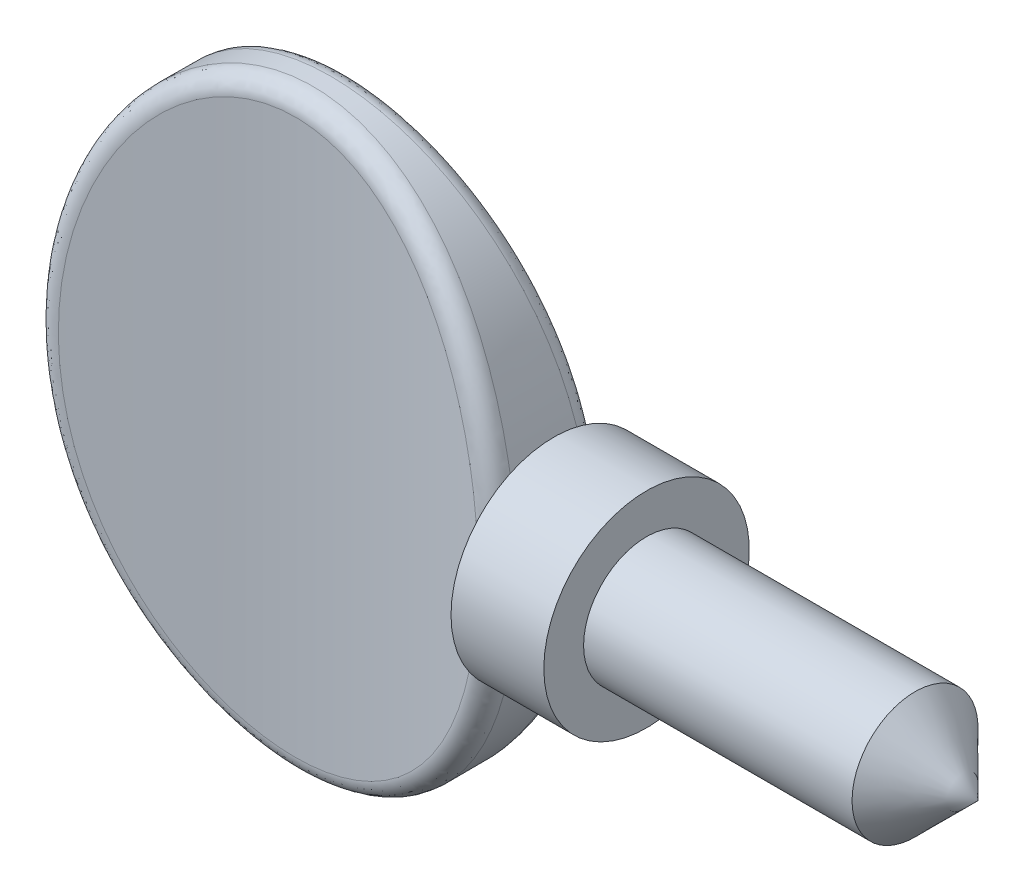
ISO-10303-21;
HEADER;
FILE_DESCRIPTION(('STEP AP214'),'2;1');
FILE_NAME('part.step','',(''),(''),'','','');
FILE_SCHEMA(('AUTOMOTIVE_DESIGN { 1 0 10303 214 1 1 1 1 }'));
ENDSEC;
DATA;
#1=APPLICATION_CONTEXT('core data for automotive mechanical design processes');
#2=APPLICATION_PROTOCOL_DEFINITION('international standard','automotive_design',2000,#1);
#3=PRODUCT_CONTEXT('',#1,'mechanical');
#4=PRODUCT('Part','Part','',(#3));
#5=PRODUCT_RELATED_PRODUCT_CATEGORY('part','',(#4));
#6=PRODUCT_DEFINITION_FORMATION('','',#4);
#7=PRODUCT_DEFINITION_CONTEXT('part definition',#1,'design');
#8=PRODUCT_DEFINITION('design','',#6,#7);
#9=PRODUCT_DEFINITION_SHAPE('','',#8);
#10=(LENGTH_UNIT() NAMED_UNIT(*) SI_UNIT(.MILLI.,.METRE.));
#11=(NAMED_UNIT(*) PLANE_ANGLE_UNIT() SI_UNIT($,.RADIAN.));
#12=(NAMED_UNIT(*) SI_UNIT($,.STERADIAN.) SOLID_ANGLE_UNIT());
#13=UNCERTAINTY_MEASURE_WITH_UNIT(LENGTH_MEASURE(1.E-05),#10,'distance_accuracy_value','');
#14=(GEOMETRIC_REPRESENTATION_CONTEXT(3) GLOBAL_UNCERTAINTY_ASSIGNED_CONTEXT((#13)) GLOBAL_UNIT_ASSIGNED_CONTEXT((#10,
#11,#12)) REPRESENTATION_CONTEXT('',''));
#15=CARTESIAN_POINT('',(0.,0.,0.));
#16=DIRECTION('',(0.,0.,1.));
#17=DIRECTION('',(1.,0.,0.));
#18=AXIS2_PLACEMENT_3D('',#15,#16,#17);
#19=CARTESIAN_POINT('',(0.,0.,2.286));
#20=DIRECTION('',(0.,0.,1.));
#21=DIRECTION('',(0.,1.,0.));
#22=AXIS2_PLACEMENT_3D('',#19,#20,#21);
#23=ELLIPSE('',#22,11.303,8.89);
#24=DIRECTION('',(0.,0.,-1.));
#25=VECTOR('',#24,1.);
#26=SURFACE_OF_LINEAR_EXTRUSION('',#23,#25);
#27=CARTESIAN_POINT('',(8.65241868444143,-2.59563035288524,1.41565744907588));
#28=CARTESIAN_POINT('',(8.64505380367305,-2.63527789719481,1.31316697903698));
#29=CARTESIAN_POINT('',(8.63830595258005,-2.67071705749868,1.20899028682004));
#30=CARTESIAN_POINT('',(8.62627848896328,-2.732857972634,0.997954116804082));
#31=CARTESIAN_POINT('',(8.6209992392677,-2.75955756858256,0.891093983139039));
#32=CARTESIAN_POINT('',(8.61214578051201,-2.8038850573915,0.675401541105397));
#33=CARTESIAN_POINT('',(8.60857205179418,-2.82151039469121,0.566568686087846));
#34=CARTESIAN_POINT('',(8.60328452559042,-2.84746342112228,0.347770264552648));
#35=CARTESIAN_POINT('',(8.60157044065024,-2.85579254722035,0.23780487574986));
#36=CARTESIAN_POINT('',(8.60008413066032,-2.86301911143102,0.018538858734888));
#37=CARTESIAN_POINT('',(8.60029463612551,-2.86200042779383,-0.0907588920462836));
#38=CARTESIAN_POINT('',(8.60260692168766,-2.8507444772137,-0.308858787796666));
#39=CARTESIAN_POINT('',(8.60470870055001,-2.8405072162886,-0.417660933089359));
#40=CARTESIAN_POINT('',(8.61070632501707,-2.810972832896,-0.633744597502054));
#41=CARTESIAN_POINT('',(8.61459849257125,-2.79169428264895,-0.741028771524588));
#42=CARTESIAN_POINT('',(8.62400975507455,-2.74432029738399,-0.953510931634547));
#43=CARTESIAN_POINT('',(8.62952797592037,-2.71622959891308,-1.05871000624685));
#44=CARTESIAN_POINT('',(8.63844994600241,-2.66982167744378,-1.20771767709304));
#45=CARTESIAN_POINT('',(8.64128872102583,-2.65493954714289,-1.25265626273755));
#46=CARTESIAN_POINT('',(8.64720516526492,-2.62361466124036,-1.34191094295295));
#47=CARTESIAN_POINT('',(8.65028255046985,-2.60717375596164,-1.3862277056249));
#48=CARTESIAN_POINT('',(8.65346985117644,-2.58995946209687,-1.43023949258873));
#49=B_SPLINE_CURVE_WITH_KNOTS('',3,(#27,#28,#29,#30,#31,#32,#33,#34,#35,#36,#37,#38,#39,#40,#41,
#42,#43,#44,#45,#46,#47,#48),.UNSPECIFIED.,.F.,.F.,(4,2,2,2,2,2,2,2,2,2,4),(0.,
0.330340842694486,0.660763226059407,0.991278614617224,1.3217429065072,1.64924484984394,
1.97674657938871,2.30357849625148,2.63023504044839,2.772481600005,2.91456137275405),.UNSPECIFIED.);
#50=CARTESIAN_POINT('',(8.64686129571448,-2.62539678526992,1.33619092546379));
#51=VERTEX_POINT('',#50);
#52=CARTESIAN_POINT('',(8.64686129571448,-2.62539678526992,-1.33619092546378));
#53=VERTEX_POINT('',#52);
#54=EDGE_CURVE('E166',#51,#53,#49,.T.);
#55=ORIENTED_EDGE('',*,*,#54,.F.);
#56=CARTESIAN_POINT('',(7.82629564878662,2.4351042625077,1.99569619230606));
#57=CARTESIAN_POINT('',(8.65245132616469,2.59576258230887,2.20582536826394));
#58=CARTESIAN_POINT('',(8.65956685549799,2.55680519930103,1.33926304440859));
#59=CARTESIAN_POINT('',(7.94743912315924,1.75770532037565,2.02649942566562));
#60=CARTESIAN_POINT('',(8.78692406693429,1.87112905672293,2.24349586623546));
#61=CARTESIAN_POINT('',(8.78960914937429,1.8448432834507,1.37072341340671));
#62=CARTESIAN_POINT('',(8.01716971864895,1.07004055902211,2.0448717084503));
#63=CARTESIAN_POINT('',(8.86351312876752,1.1404733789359,2.26573738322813));
#64=CARTESIAN_POINT('',(8.86432478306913,1.12299912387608,1.38948763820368));
#65=CARTESIAN_POINT('',(8.0547289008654,-0.309351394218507,2.05469325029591));
#66=CARTESIAN_POINT('',(8.90506846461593,-0.330332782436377,2.27771295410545));
#67=CARTESIAN_POINT('',(8.90458477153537,-0.324674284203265,1.399518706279));
#68=CARTESIAN_POINT('',(8.02243825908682,-1.00108239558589,2.04611100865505));
#69=CARTESIAN_POINT('',(8.86961883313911,-1.06541121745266,2.26732632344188));
#70=CARTESIAN_POINT('',(8.87000139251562,-1.05050720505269,1.39075337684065));
#71=CARTESIAN_POINT('',(7.89401839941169,-2.05341820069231,2.01297572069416));
#72=CARTESIAN_POINT('',(8.7273712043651,-2.18848798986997,2.22688533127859));
#73=CARTESIAN_POINT('',(8.7322517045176,-2.15566998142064,1.35691120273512));
#74=CARTESIAN_POINT('',(7.83428558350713,-2.41932216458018,1.99763575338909));
#75=CARTESIAN_POINT('',(8.66147254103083,-2.57804176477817,2.20823888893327));
#76=CARTESIAN_POINT('',(8.66816384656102,-2.54012241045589,1.34124398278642));
#77=CARTESIAN_POINT('',(7.68487396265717,-3.14447608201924,1.95997275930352));
#78=CARTESIAN_POINT('',(8.49634767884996,-3.35051128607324,2.16238668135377));
#79=CARTESIAN_POINT('',(8.50770464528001,-3.302633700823,1.30277751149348));
#80=CARTESIAN_POINT('',(7.59519051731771,-3.50372499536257,1.93764865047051));
#81=CARTESIAN_POINT('',(8.39743269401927,-3.73273694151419,2.13526405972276));
#82=CARTESIAN_POINT('',(8.41132829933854,-3.68069156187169,1.27997715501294));
#83=CARTESIAN_POINT('',(7.38556781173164,-4.21216799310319,1.88675959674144));
#84=CARTESIAN_POINT('',(8.16589203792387,-4.48682518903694,2.07336294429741));
#85=CARTESIAN_POINT('',(8.18576943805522,-4.42707064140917,1.22800246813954));
#86=CARTESIAN_POINT('',(7.26565071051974,-4.56136923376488,1.8581992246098));
#87=CARTESIAN_POINT('',(8.0337174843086,-4.85809981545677,2.03869510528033));
#88=CARTESIAN_POINT('',(8.05661094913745,-4.79539877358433,1.19883280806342));
#89=CARTESIAN_POINT('',(6.995124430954,-5.2464697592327,1.79585403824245));
#90=CARTESIAN_POINT('',(7.73510821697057,-5.5867008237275,1.96294144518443));
#91=CARTESIAN_POINT('',(7.76473855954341,-5.51911593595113,1.13515759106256));
#92=CARTESIAN_POINT('',(6.84452615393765,-5.58237371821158,1.76207108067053));
#93=CARTESIAN_POINT('',(7.56920233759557,-5.94356882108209,1.92197039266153));
#94=CARTESIAN_POINT('',(7.60203657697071,-5.87450950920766,1.10065393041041));
#95=CARTESIAN_POINT('',(6.43324199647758,-6.39240336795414,1.67357133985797));
#96=CARTESIAN_POINT('',(7.1165122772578,-6.80243787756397,1.81477728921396));
#97=CARTESIAN_POINT('',(7.15675137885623,-6.73320066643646,1.01026619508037));
#98=CARTESIAN_POINT('',(6.15417610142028,-6.85676635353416,1.61651047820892));
#99=CARTESIAN_POINT('',(6.80972916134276,-7.29531731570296,1.74570436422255));
#100=CARTESIAN_POINT('',(6.85386362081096,-7.22695535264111,0.951988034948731));
#101=CARTESIAN_POINT('',(5.52696453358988,-7.73305703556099,1.49913786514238));
#102=CARTESIAN_POINT('',(6.11796499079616,-8.22578037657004,1.60333969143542));
#103=CARTESIAN_POINT('',(6.17012522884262,-8.16227422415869,0.832111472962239));
#104=CARTESIAN_POINT('',(5.1789299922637,-8.14506735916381,1.43883145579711));
#105=CARTESIAN_POINT('',(5.73502064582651,-8.66343687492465,1.53025899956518));
#106=CARTESIAN_POINT('',(5.78939998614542,-8.60392057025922,0.770518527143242));
#107=CARTESIAN_POINT('',(4.49456535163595,-8.81832678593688,1.33426170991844));
#108=CARTESIAN_POINT('',(4.97849314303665,-9.37945459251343,1.4032069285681));
#109=CARTESIAN_POINT('',(5.0366311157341,-9.32899377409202,0.663717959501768));
#110=CARTESIAN_POINT('',(4.17119435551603,-9.09305461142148,1.28929359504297));
#111=CARTESIAN_POINT('',(4.62171828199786,-9.67163474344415,1.34859286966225));
#112=CARTESIAN_POINT('',(4.67963160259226,-9.62615608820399,0.617790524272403));
#113=CARTESIAN_POINT('',(3.65633336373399,-9.46244525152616,1.22675958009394));
#114=CARTESIAN_POINT('',(4.05119027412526,-10.0652330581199,1.27244557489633));
#115=CARTESIAN_POINT('',(4.10859190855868,-10.0272910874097,0.553922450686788));
#116=CARTESIAN_POINT('',(3.47966977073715,-9.5784960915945,1.2067276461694));
#117=CARTESIAN_POINT('',(3.85593810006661,-10.1886210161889,1.24810451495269));
#118=CARTESIAN_POINT('',(3.91223716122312,-10.1536091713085,0.533463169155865));
#119=CARTESIAN_POINT('',(3.11708209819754,-9.79472651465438,1.16885648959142));
#120=CARTESIAN_POINT('',(3.45504248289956,-10.4184405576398,1.20209344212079));
#121=CARTESIAN_POINT('',(3.50833839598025,-10.3894449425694,0.494784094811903));
#122=CARTESIAN_POINT('',(2.93116240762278,-9.89491352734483,1.15101624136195));
#123=CARTESIAN_POINT('',(3.2493632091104,-10.5250344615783,1.18039540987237));
#124=CARTESIAN_POINT('',(3.30079967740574,-10.4989704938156,0.476563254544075));
#125=CARTESIAN_POINT('',(2.54905941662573,-10.0787208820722,1.11790469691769));
#126=CARTESIAN_POINT('',(2.82653251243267,-10.7204996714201,1.14013561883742));
#127=CARTESIAN_POINT('',(2.87336447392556,-10.7002891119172,0.442745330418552));
#128=CARTESIAN_POINT('',(2.35279103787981,-10.162162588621,1.10266133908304));
#129=CARTESIAN_POINT('',(2.60916890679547,-10.8093536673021,1.12157484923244));
#130=CARTESIAN_POINT('',(2.65336386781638,-10.7918907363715,0.427176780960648));
#131=CARTESIAN_POINT('',(1.95321853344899,-10.3095327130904,1.0755046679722));
#132=CARTESIAN_POINT('',(2.16659574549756,-10.9661742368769,1.08852563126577));
#133=CARTESIAN_POINT('',(2.20463537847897,-10.9539332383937,0.399440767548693));
#134=CARTESIAN_POINT('',(1.74991833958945,-10.3734718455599,1.06358952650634));
#135=CARTESIAN_POINT('',(1.94121514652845,-11.0343149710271,1.07400206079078));
#136=CARTESIAN_POINT('',(1.97591236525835,-11.0243857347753,0.387271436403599));
#137=CARTESIAN_POINT('',(1.33807057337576,-10.4804542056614,1.04353897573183));
#138=CARTESIAN_POINT('',(1.48468245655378,-11.1482227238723,1.04958182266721));
#139=CARTESIAN_POINT('',(1.51188091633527,-11.1424052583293,0.366793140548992));
#140=CARTESIAN_POINT('',(1.12952697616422,-10.5235127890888,1.03540078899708));
#141=CARTESIAN_POINT('',(1.2532927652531,-11.1941423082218,1.03965311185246));
#142=CARTESIAN_POINT('',(1.27657745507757,-11.1899891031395,0.358481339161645));
#143=CARTESIAN_POINT('',(0.709126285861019,-10.5877622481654,1.02322405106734));
#144=CARTESIAN_POINT('',(0.787001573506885,-11.2625799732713,1.02481403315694));
#145=CARTESIAN_POINT('',(0.8017907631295,-11.2610341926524,0.346044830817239));
#146=CARTESIAN_POINT('',(0.49726981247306,-10.6089571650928,1.01918474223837));
#147=CARTESIAN_POINT('',(0.55180519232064,-11.2851925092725,1.0198833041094));
#148=CARTESIAN_POINT('',(0.562308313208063,-11.2844998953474,0.341919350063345));
#149=CARTESIAN_POINT('',(0.105050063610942,-10.627432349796,1.01566371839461));
#150=CARTESIAN_POINT('',(0.116614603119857,-11.3048795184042,1.01559044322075));
#151=CARTESIAN_POINT('',(0.118812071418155,-11.304954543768,0.338323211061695));
#152=CARTESIAN_POINT('',(-0.0751715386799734,-10.6278758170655,1.01557916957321));
#153=CARTESIAN_POINT('',(-0.0834564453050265,-11.3053519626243,1.01548738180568));
#154=CARTESIAN_POINT('',(-0.0850214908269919,-11.3054455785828,0.338236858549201));
#155=CARTESIAN_POINT('',(-0.434937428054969,-10.6127090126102,1.01846977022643));
#156=CARTESIAN_POINT('',(-0.482622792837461,-11.2891920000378,1.01901126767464));
#157=CARTESIAN_POINT('',(-0.491831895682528,-11.2886536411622,0.341189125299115));
#158=CARTESIAN_POINT('',(-0.614481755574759,-10.5970997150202,1.02144473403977));
#159=CARTESIAN_POINT('',(-0.681915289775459,-11.2725446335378,1.0226414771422));
#160=CARTESIAN_POINT('',(-0.694808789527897,-11.2713717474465,0.34422755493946));
#161=CARTESIAN_POINT('',(-0.971475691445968,-10.5501136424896,1.03036356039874));
#162=CARTESIAN_POINT('',(-1.0779135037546,-11.2224918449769,1.03351143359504));
#163=CARTESIAN_POINT('',(-1.0981231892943,-11.2193981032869,0.353336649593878));
#164=CARTESIAN_POINT('',(-1.14892554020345,-10.5187386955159,1.03630707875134));
#165=CARTESIAN_POINT('',(-1.27480360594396,-11.1890405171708,1.04076111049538));
#166=CARTESIAN_POINT('',(-1.29846099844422,-11.1847083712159,0.359406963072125));
#167=CARTESIAN_POINT('',(-1.50046734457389,-10.4407724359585,1.05098693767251));
#168=CARTESIAN_POINT('',(-1.66458038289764,-11.1060123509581,1.05864455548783));
#169=CARTESIAN_POINT('',(-1.69492269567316,-11.0986163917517,0.374399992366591));
#170=CARTESIAN_POINT('',(-1.6745592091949,-10.3941807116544,1.05972335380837));
#171=CARTESIAN_POINT('',(-1.85762658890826,-11.056361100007,1.06929413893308));
#172=CARTESIAN_POINT('',(-1.89104646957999,-11.047213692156,0.383322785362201));
#173=CARTESIAN_POINT('',(-2.01159554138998,-10.2886238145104,1.07935663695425));
#174=CARTESIAN_POINT('',(-2.23106714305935,-10.9440082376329,1.09319591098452));
#175=CARTESIAN_POINT('',(-2.27021161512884,-10.9309431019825,0.403374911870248));
#176=CARTESIAN_POINT('',(-2.17471076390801,-10.2302066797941,1.0901569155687));
#177=CARTESIAN_POINT('',(-2.4117997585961,-10.8817955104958,1.10635018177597));
#178=CARTESIAN_POINT('',(-2.45346562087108,-10.8666726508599,0.414405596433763));
#179=CARTESIAN_POINT('',(-2.4959633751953,-10.1008201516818,1.11384924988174));
#180=CARTESIAN_POINT('',(-2.76753136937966,-10.744137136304,1.13517612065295));
#181=CARTESIAN_POINT('',(-2.81382794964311,-10.7245661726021,0.438603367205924));
#182=CARTESIAN_POINT('',(-2.6540991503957,-10.0298467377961,1.12674197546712));
#183=CARTESIAN_POINT('',(-2.94261127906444,-10.6685976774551,1.15086640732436));
#184=CARTESIAN_POINT('',(-2.99093428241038,-10.6467258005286,0.451771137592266));
#185=CARTESIAN_POINT('',(-3.11989632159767,-9.79942559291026,1.16812424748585));
#186=CARTESIAN_POINT('',(-3.45909560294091,-10.4230523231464,1.20128501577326));
#187=CARTESIAN_POINT('',(-3.51173172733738,-10.394478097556,0.494036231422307));
#188=CARTESIAN_POINT('',(-3.41911154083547,-9.62242439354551,1.19932790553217));
#189=CARTESIAN_POINT('',(-3.79004687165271,-10.2345494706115,1.23926399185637));
#190=CARTESIAN_POINT('',(-3.84508579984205,-10.20128606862,0.52590556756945));
#191=CARTESIAN_POINT('',(-4.09904643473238,-9.15457953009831,1.27920788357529));
#192=CARTESIAN_POINT('',(-4.54276316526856,-9.7366002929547,1.33643019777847));
#193=CARTESIAN_POINT('',(-4.59999386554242,-9.69271674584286,0.607489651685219));
#194=CARTESIAN_POINT('',(-4.4677733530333,-8.84600074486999,1.33002831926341));
#195=CARTESIAN_POINT('',(-4.94952770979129,-9.40827652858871,1.39816929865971));
#196=CARTESIAN_POINT('',(-5.00720170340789,-9.35876546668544,0.659394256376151));
#197=CARTESIAN_POINT('',(-5.1506512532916,-8.17151649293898,1.43465606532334));
#198=CARTESIAN_POINT('',(-5.70311367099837,-8.69214633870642,1.52508390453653));
#199=CARTESIAN_POINT('',(-5.75825220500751,-8.63243872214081,0.766254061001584));
#200=CARTESIAN_POINT('',(-5.46469809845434,-7.80550411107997,1.48846882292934));
#201=CARTESIAN_POINT('',(-6.04883115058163,-8.30338280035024,1.59030661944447));
#202=CARTESIAN_POINT('',(-6.10197403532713,-8.23995436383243,0.821214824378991));
#203=CARTESIAN_POINT('',(-6.11532335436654,-6.92506403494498,1.6082879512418));
#204=CARTESIAN_POINT('',(-6.76780893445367,-7.36679603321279,1.7359003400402));
#205=CARTESIAN_POINT('',(-6.81177427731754,-7.29951289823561,0.943590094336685));
#206=CARTESIAN_POINT('',(-6.43476934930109,-6.39735552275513,1.67362664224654));
#207=CARTESIAN_POINT('',(-7.11866978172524,-6.80670608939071,1.81495566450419));
#208=CARTESIAN_POINT('',(-7.15847428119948,-6.73831516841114,1.01032267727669));
#209=CARTESIAN_POINT('',(-6.98586982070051,-5.29504721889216,1.79279155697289));
#210=CARTESIAN_POINT('',(-7.72672939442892,-5.63515267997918,1.95964859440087));
#211=CARTESIAN_POINT('',(-7.75498793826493,-5.57007516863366,1.13202977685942));
#212=CARTESIAN_POINT('',(-7.21743550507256,-4.72040071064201,1.84660611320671));
#213=CARTESIAN_POINT('',(-7.98107986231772,-5.02517153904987,2.02476167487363));
#214=CARTESIAN_POINT('',(-8.00470360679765,-4.96298727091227,1.18699237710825));
#215=CARTESIAN_POINT('',(-7.59788704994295,-3.53286241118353,1.93787390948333));
#216=CARTESIAN_POINT('',(-8.40127783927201,-3.76125290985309,2.13576419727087));
#217=CARTESIAN_POINT('',(-8.41432758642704,-3.71108875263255,1.28020721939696));
#218=CARTESIAN_POINT('',(-7.74551320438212,-2.91953395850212,1.97507615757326));
#219=CARTESIAN_POINT('',(-8.56353360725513,-3.10968614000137,2.18081781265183));
#220=CARTESIAN_POINT('',(-8.572867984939,-3.06585606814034,1.31820311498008));
#221=CARTESIAN_POINT('',(-7.95444111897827,-1.67779030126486,2.02838222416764));
#222=CARTESIAN_POINT('',(-8.79452477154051,-1.78651139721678,2.24575202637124));
#223=CARTESIAN_POINT('',(-8.79710310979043,-1.76097068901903,1.37264637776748));
#224=CARTESIAN_POINT('',(-8.01589074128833,-1.04940282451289,2.04452217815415));
#225=CARTESIAN_POINT('',(-8.86213168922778,-1.11847428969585,2.26532120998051));
#226=CARTESIAN_POINT('',(-8.86295686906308,-1.10134467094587,1.38913065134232));
#227=CARTESIAN_POINT('',(-8.04339962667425,-0.134428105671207,2.05173737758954));
#228=CARTESIAN_POINT('',(-8.89250870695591,-0.143244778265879,2.27410147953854));
#229=CARTESIAN_POINT('',(-8.89243947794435,-0.141070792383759,1.39649977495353));
#230=CARTESIAN_POINT('',(-8.04322422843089,0.151433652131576,2.05168672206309));
#231=CARTESIAN_POINT('',(-8.89232438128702,0.161377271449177,2.2740424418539));
#232=CARTESIAN_POINT('',(-8.8922524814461,0.158917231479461,1.39644803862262));
#233=CARTESIAN_POINT('',(-8.02535656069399,0.722706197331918,2.04701032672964));
#234=CARTESIAN_POINT('',(-8.87256700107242,0.770474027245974,2.26834414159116));
#235=CARTESIAN_POINT('',(-8.87310070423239,0.758474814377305,1.39167188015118));
#236=CARTESIAN_POINT('',(-8.00765727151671,1.00811675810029,2.04238275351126));
#237=CARTESIAN_POINT('',(-8.85300951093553,1.07458955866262,2.26270936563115));
#238=CARTESIAN_POINT('',(-8.85412839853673,1.05804415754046,1.3869455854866));
#239=CARTESIAN_POINT('',(-7.947886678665,1.6500558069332,2.02685880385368));
#240=CARTESIAN_POINT('',(-8.78692419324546,1.75875334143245,2.24379627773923));
#241=CARTESIAN_POINT('',(-8.79003704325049,1.73201243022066,1.37109045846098));
#242=CARTESIAN_POINT('',(-7.90073256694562,2.00606858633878,2.01465999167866));
#243=CARTESIAN_POINT('',(-8.73487578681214,2.1378622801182,2.22895949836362));
#244=CARTESIAN_POINT('',(-8.73946402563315,2.10591711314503,1.35863140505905));
#245=CARTESIAN_POINT('',(-7.77848949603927,2.71274841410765,1.98351195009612));
#246=CARTESIAN_POINT('',(-8.5997385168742,2.89083812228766,2.19102428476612));
#247=CARTESIAN_POINT('',(-8.6082550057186,2.84858479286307,1.3268188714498));
#248=CARTESIAN_POINT('',(-7.70339994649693,3.063415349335,1.9645625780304));
#249=CARTESIAN_POINT('',(-8.51689426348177,3.26405432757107,2.16799271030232));
#250=CARTESIAN_POINT('',(-8.52761836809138,3.21734768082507,1.30746524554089));
#251=CARTESIAN_POINT('',(-7.52482874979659,3.75734261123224,1.92045005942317));
#252=CARTESIAN_POINT('',(-8.3196020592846,4.00293869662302,2.11431336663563));
#253=CARTESIAN_POINT('',(-8.33564394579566,3.94777946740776,1.26241165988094));
#254=CARTESIAN_POINT('',(-7.42130346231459,4.10059067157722,1.89527736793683));
#255=CARTESIAN_POINT('',(-8.20545267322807,4.36801638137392,2.0837427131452));
#256=CARTESIAN_POINT('',(-8.22425897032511,4.30943653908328,1.23670195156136));
#257=CARTESIAN_POINT('',(-7.18557888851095,4.77601163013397,1.83956259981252));
#258=CARTESIAN_POINT('',(-7.94517850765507,5.08660176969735,2.01601312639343));
#259=CARTESIAN_POINT('',(-7.97026371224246,5.02200340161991,1.17979860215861));
#260=CARTESIAN_POINT('',(-7.05338947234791,5.10818829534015,1.80902237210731));
#261=CARTESIAN_POINT('',(-7.79950129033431,5.43963428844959,1.97895746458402));
#262=CARTESIAN_POINT('',(-7.8276641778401,5.37291684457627,1.14860684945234));
#263=CARTESIAN_POINT('',(-6.67495246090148,5.94632514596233,1.72466643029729));
#264=CARTESIAN_POINT('',(-7.38297359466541,6.32842399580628,1.8767643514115));
#265=CARTESIAN_POINT('',(-7.4186740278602,6.25981775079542,1.06245131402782));
#266=CARTESIAN_POINT('',(-6.40690462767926,6.44195824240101,1.66758899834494));
#267=CARTESIAN_POINT('',(-7.08838989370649,6.8544708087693,1.80768456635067));
#268=CARTESIAN_POINT('',(-7.12833321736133,6.78575428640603,1.00415623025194));
#269=CARTESIAN_POINT('',(-5.79654461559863,7.38178409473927,1.54807423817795));
#270=CARTESIAN_POINT('',(-6.41517877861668,7.85259495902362,1.66268974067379));
#271=CARTESIAN_POINT('',(-6.46441231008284,7.78670698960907,0.882091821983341));
#272=CARTESIAN_POINT('',(-5.45436166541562,7.82606432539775,1.48564634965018));
#273=CARTESIAN_POINT('',(-6.03887887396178,8.32439730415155,1.58707563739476));
#274=CARTESIAN_POINT('',(-6.09097702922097,8.26180964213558,0.81833213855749));
#275=CARTESIAN_POINT('',(-4.77789167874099,8.55448470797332,1.37612062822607));
#276=CARTESIAN_POINT('',(-5.29119543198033,9.09910698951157,1.45400801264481));
#277=CARTESIAN_POINT('',(-5.34869298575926,9.04439141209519,0.70646986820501));
#278=CARTESIAN_POINT('',(-4.45799420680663,8.85245688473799,1.32863499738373));
#279=CARTESIAN_POINT('',(-4.93851328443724,9.41585809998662,1.39637707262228));
#280=CARTESIAN_POINT('',(-4.99642235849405,9.36587548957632,0.65797121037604));
#281=CARTESIAN_POINT('',(-3.77461012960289,9.39190551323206,1.23929408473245));
#282=CARTESIAN_POINT('',(-4.18378611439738,9.98880971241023,1.2879446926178));
#283=CARTESIAN_POINT('',(-4.24030383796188,9.95027102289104,0.566724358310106));
#284=CARTESIAN_POINT('',(-3.41117328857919,9.63344555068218,1.19743248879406));
#285=CARTESIAN_POINT('',(-3.78213052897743,10.2460992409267,1.237002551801));
#286=CARTESIAN_POINT('',(-3.83651479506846,10.2132483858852,0.523969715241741));
#287=CARTESIAN_POINT('',(-2.7071131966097,10.0130852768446,1.12997552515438));
#288=CARTESIAN_POINT('',(-3.00265612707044,10.6500345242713,1.15495053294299));
#289=CARTESIAN_POINT('',(-3.05059237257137,10.6281650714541,0.455073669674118));
#290=CARTESIAN_POINT('',(-2.37204630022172,10.1615243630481,1.10285226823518));
#291=CARTESIAN_POINT('',(-2.63139042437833,10.8083853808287,1.12186903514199));
#292=CARTESIAN_POINT('',(-2.67521894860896,10.7911098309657,0.427371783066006));
#293=CARTESIAN_POINT('',(-1.85473120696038,10.3404490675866,1.06974582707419));
#294=CARTESIAN_POINT('',(-2.05733540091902,10.9991414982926,1.08150227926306));
#295=CARTESIAN_POINT('',(-2.09383679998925,10.9879949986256,0.393559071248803));
#296=CARTESIAN_POINT('',(-1.67979337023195,10.3928095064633,1.05997187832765));
#297=CARTESIAN_POINT('',(-1.86339026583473,11.0549303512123,1.06959065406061));
#298=CARTESIAN_POINT('',(-1.89693593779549,11.045710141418,0.383576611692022));
#299=CARTESIAN_POINT('',(-1.32608818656,10.4821521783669,1.04321230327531));
#300=CARTESIAN_POINT('',(-1.47128411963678,11.1500600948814,1.04917741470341));
#301=CARTESIAN_POINT('',(-1.49833774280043,11.1442889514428,0.366459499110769));
#302=CARTESIAN_POINT('',(-1.14732240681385,10.5191405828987,1.03622555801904));
#303=CARTESIAN_POINT('',(-1.27297000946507,11.1894916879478,1.04065670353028));
#304=CARTESIAN_POINT('',(-1.29664236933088,11.1851593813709,0.359323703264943));
#305=CARTESIAN_POINT('',(-0.786475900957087,10.5772111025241,1.02522674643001));
#306=CARTESIAN_POINT('',(-0.872750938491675,11.2513466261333,1.0272534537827));
#307=CARTESIAN_POINT('',(-0.8891721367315,11.2493631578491,0.348090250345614));
#308=CARTESIAN_POINT('',(-0.604384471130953,10.5982263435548,1.02122718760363));
#309=CARTESIAN_POINT('',(-0.670646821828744,11.2737587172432,1.02237324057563));
#310=CARTESIAN_POINT('',(-0.683383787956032,11.2726227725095,0.344005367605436));
#311=CARTESIAN_POINT('',(-0.239046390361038,10.6237097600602,1.01637444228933));
#312=CARTESIAN_POINT('',(-0.265317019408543,11.3009091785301,1.01645776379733));
#313=CARTESIAN_POINT('',(-0.270347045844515,11.3008314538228,0.339049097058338));
#314=CARTESIAN_POINT('',(-0.0557997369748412,10.6281779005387,1.01552126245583));
#315=CARTESIAN_POINT('',(-0.0618866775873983,11.3056751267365,1.01541649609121));
#316=CARTESIAN_POINT('',(-0.0630986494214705,11.3057804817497,0.338177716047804));
#317=CARTESIAN_POINT('',(0.310342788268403,10.6204795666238,1.01698891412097));
#318=CARTESIAN_POINT('',(0.344362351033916,11.2974728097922,1.01720566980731));
#319=CARTESIAN_POINT('',(0.350954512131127,11.2972566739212,0.339676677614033));
#320=CARTESIAN_POINT('',(0.493238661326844,10.6083131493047,1.0193097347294));
#321=CARTESIAN_POINT('',(0.547389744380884,11.2844961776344,1.02003793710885));
#322=CARTESIAN_POINT('',(0.557759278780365,11.2837839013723,0.342047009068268));
#323=CARTESIAN_POINT('',(0.857193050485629,10.5675786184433,1.02705146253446));
#324=CARTESIAN_POINT('',(0.951137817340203,11.2411005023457,1.02947400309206));
#325=CARTESIAN_POINT('',(0.969049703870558,11.2387130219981,0.349953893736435));
#326=CARTESIAN_POINT('',(1.03825162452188,10.5390110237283,1.03247227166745));
#327=CARTESIAN_POINT('',(1.15205642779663,11.2106386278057,1.03608708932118));
#328=CARTESIAN_POINT('',(1.17353543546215,11.2071154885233,0.355490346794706));
#329=CARTESIAN_POINT('',(1.38577241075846,10.4683102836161,1.04581044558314));
#330=CARTESIAN_POINT('',(1.53738746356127,11.1353476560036,1.05233647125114));
#331=CARTESIAN_POINT('',(1.56562555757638,11.1290138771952,0.36911306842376));
#332=CARTESIAN_POINT('',(1.55243251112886,10.4271514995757,1.05354783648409));
#333=CARTESIAN_POINT('',(1.72221209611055,11.0914846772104,1.06176887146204));
#334=CARTESIAN_POINT('',(1.75347855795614,11.0835813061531,0.377015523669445));
#335=CARTESIAN_POINT('',(1.88194456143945,10.3315323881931,1.07139376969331));
#336=CARTESIAN_POINT('',(2.08740434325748,10.9896901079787,1.08349994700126));
#337=CARTESIAN_POINT('',(2.12443081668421,10.9781855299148,0.395242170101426));
#338=CARTESIAN_POINT('',(2.0447952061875,10.2770675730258,1.08150311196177));
#339=CARTESIAN_POINT('',(2.26788778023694,10.9316775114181,1.09581547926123));
#340=CARTESIAN_POINT('',(2.30752844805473,10.9182174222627,0.405567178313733));
#341=CARTESIAN_POINT('',(2.52615676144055,10.0948432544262,1.11502540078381));
#342=CARTESIAN_POINT('',(2.80192013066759,10.7374389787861,1.13667911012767));
#343=CARTESIAN_POINT('',(2.84792805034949,10.7179160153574,0.439804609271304));
#344=CARTESIAN_POINT('',(2.83775186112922,9.94819639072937,1.14164376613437));
#345=CARTESIAN_POINT('',(3.14702031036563,10.5810992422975,1.16912176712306));
#346=CARTESIAN_POINT('',(3.19664674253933,10.5571217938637,0.466990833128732));
#347=CARTESIAN_POINT('',(3.46147687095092,9.59774159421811,1.20356654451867));
#348=CARTESIAN_POINT('',(3.83708974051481,10.2084377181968,1.24439518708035));
#349=CARTESIAN_POINT('',(3.89231625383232,10.1744153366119,0.530234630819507));
#350=CARTESIAN_POINT('',(3.77151791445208,9.3902081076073,1.23940741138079));
#351=CARTESIAN_POINT('',(4.17970555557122,9.98753738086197,1.28798248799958));
#352=CARTESIAN_POINT('',(4.23673354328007,9.94854700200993,0.56684010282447));
#353=CARTESIAN_POINT('',(4.35991988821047,8.93336469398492,1.3153767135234));
#354=CARTESIAN_POINT('',(4.82954880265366,9.50230750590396,1.38018944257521));
#355=CARTESIAN_POINT('',(4.88803612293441,9.45342711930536,0.644430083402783));
#356=CARTESIAN_POINT('',(4.63825599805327,8.68402240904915,1.3555084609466));
#357=CARTESIAN_POINT('',(5.1365679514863,9.23728381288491,1.42890183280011));
#358=CARTESIAN_POINT('',(5.19489202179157,9.18414197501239,0.685417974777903));
#359=CARTESIAN_POINT('',(5.2883525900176,8.02265329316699,1.45704370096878));
#360=CARTESIAN_POINT('',(5.8558547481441,8.53323619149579,1.55237909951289));
#361=CARTESIAN_POINT('',(5.90931964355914,8.47252416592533,0.789119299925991));
#362=CARTESIAN_POINT('',(5.64019381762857,7.59026791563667,1.51934813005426));
#363=CARTESIAN_POINT('',(6.24288672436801,8.07397250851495,1.62786734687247));
#364=CARTESIAN_POINT('',(6.29382777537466,8.00948569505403,0.852752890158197));
#365=CARTESIAN_POINT('',(6.27033111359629,6.67225546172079,1.63966575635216));
#366=CARTESIAN_POINT('',(6.93790446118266,7.09909556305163,1.77382186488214));
#367=CARTESIAN_POINT('',(6.98009678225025,7.03057005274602,0.975637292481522));
#368=CARTESIAN_POINT('',(6.54850581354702,6.18654236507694,1.69767175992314));
#369=CARTESIAN_POINT('',(7.2436171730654,6.58356877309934,1.84402554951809));
#370=CARTESIAN_POINT('',(7.28172113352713,6.51460760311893,1.03488075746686));
#371=CARTESIAN_POINT('',(7.03636802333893,5.17052156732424,1.80448690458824));
#372=CARTESIAN_POINT('',(7.7819565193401,5.50356359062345,1.97373871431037));
#373=CARTESIAN_POINT('',(7.80945284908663,5.43850602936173,1.14397462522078));
#374=CARTESIAN_POINT('',(7.24495455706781,4.63964991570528,1.85314346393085));
#375=CARTESIAN_POINT('',(8.01126147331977,4.93984669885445,2.03265655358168));
#376=CARTESIAN_POINT('',(8.03434739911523,4.87781622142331,1.19366919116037));
#377=CARTESIAN_POINT('',(7.5896007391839,3.55324278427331,1.93595435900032));
#378=CARTESIAN_POINT('',(8.39188677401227,3.78362130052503,2.13336693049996));
#379=CARTESIAN_POINT('',(8.40539047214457,3.7326204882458,1.27824671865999));
#380=CARTESIAN_POINT('',(7.72568060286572,2.99771422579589,1.97011273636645));
#381=CARTESIAN_POINT('',(8.54157946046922,3.19321802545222,2.17476629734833));
#382=CARTESIAN_POINT('',(8.55156094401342,3.14812125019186,1.31313380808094));
#383=CARTESIAN_POINT('',(7.82629564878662,2.4351042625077,1.99569619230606));
#384=CARTESIAN_POINT('',(8.65245132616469,2.59576258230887,2.20582536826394));
#385=CARTESIAN_POINT('',(8.65956685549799,2.55680519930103,1.33926304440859));
#386=(BOUNDED_SURFACE() B_SPLINE_SURFACE(3,2,((#56,#57,#58),(#59,#60,#61),(#62,#63,#64),(#65,
#66,#67),(#68,#69,#70),(#71,#72,#73),(#74,#75,#76),(#77,#78,#79),(#80,#81,#82),(#83,#84,#85),
(#86,#87,#88),(#89,#90,#91),(#92,#93,#94),(#95,#96,#97),(#98,#99,#100),(#101,#102,#103),(#104,
#105,#106),(#107,#108,#109),(#110,#111,#112),(#113,#114,#115),(#116,#117,#118),(#119,#120,#121),
(#122,#123,#124),(#125,#126,#127),(#128,#129,#130),(#131,#132,#133),(#134,#135,#136),(#137,#138,
#139),(#140,#141,#142),(#143,#144,#145),(#146,#147,#148),(#149,#150,#151),(#152,#153,#154),
(#155,#156,#157),(#158,#159,#160),(#161,#162,#163),(#164,#165,#166),(#167,#168,#169),(#170,#171,
#172),(#173,#174,#175),(#176,#177,#178),(#179,#180,#181),(#182,#183,#184),(#185,#186,#187),
(#188,#189,#190),(#191,#192,#193),(#194,#195,#196),(#197,#198,#199),(#200,#201,#202),(#203,#204,
#205),(#206,#207,#208),(#209,#210,#211),(#212,#213,#214),(#215,#216,#217),(#218,#219,#220),
(#221,#222,#223),(#224,#225,#226),(#227,#228,#229),(#230,#231,#232),(#233,#234,#235),(#236,#237,
#238),(#239,#240,#241),(#242,#243,#244),(#245,#246,#247),(#248,#249,#250),(#251,#252,#253),
(#254,#255,#256),(#257,#258,#259),(#260,#261,#262),(#263,#264,#265),(#266,#267,#268),(#269,#270,
#271),(#272,#273,#274),(#275,#276,#277),(#278,#279,#280),(#281,#282,#283),(#284,#285,#286),
(#287,#288,#289),(#290,#291,#292),(#293,#294,#295),(#296,#297,#298),(#299,#300,#301),(#302,#303,
#304),(#305,#306,#307),(#308,#309,#310),(#311,#312,#313),(#314,#315,#316),(#317,#318,#319),
(#320,#321,#322),(#323,#324,#325),(#326,#327,#328),(#329,#330,#331),(#332,#333,#334),(#335,#336,
#337),(#338,#339,#340),(#341,#342,#343),(#344,#345,#346),(#347,#348,#349),(#350,#351,#352),
(#353,#354,#355),(#356,#357,#358),(#359,#360,#361),(#362,#363,#364),(#365,#366,#367),(#368,#369,
#370),(#371,#372,#373),(#374,#375,#376),(#377,#378,#379),(#380,#381,#382),(#383,#384,#385)),
.UNSPECIFIED.,.T.,.F.,.F.) B_SPLINE_SURFACE_WITH_KNOTS((4,2,2,2,2,2,2,2,2,2,2,2,2,2,2,2,2,2,2,2,
2,2,2,2,2,2,2,2,2,2,2,2,2,2,2,2,2,2,2,2,2,2,2,2,2,2,2,2,2,2,2,2,2,2,4),(3,3),(0.,
2.06622314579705,4.13486190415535,5.24755247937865,6.36041552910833,7.4724652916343,
8.58412061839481,10.2215277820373,11.8563176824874,13.1469674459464,13.792803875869,
14.4383369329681,15.0904277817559,15.7421597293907,16.3934116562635,17.0445431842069,
17.5960362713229,18.1474958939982,18.6988915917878,19.2503022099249,19.7803937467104,
20.3106553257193,21.3706565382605,22.831692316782,24.295480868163,26.1576819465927,
28.0217595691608,29.9131198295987,31.8012308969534,32.6583453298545,33.5158032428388,
34.5929671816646,35.6701538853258,36.7490030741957,37.8274813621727,39.5282876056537,
41.226152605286,42.5557025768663,43.883747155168,45.0006946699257,45.5594567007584,
46.1179941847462,46.6788573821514,47.2397217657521,47.8005842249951,48.3614289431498,
48.8867331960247,49.4122148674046,50.4623283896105,51.5993275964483,52.737210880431,
54.4254075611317,56.116368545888,57.8329376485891,59.5490279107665),(0.,1.),
.UNSPECIFIED.) GEOMETRIC_REPRESENTATION_ITEM() RATIONAL_B_SPLINE_SURFACE(((1.,0.615432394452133,
1.),(1.,0.61297474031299,1.),(1.,0.611532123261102,1.),(1.,0.610758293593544,1.),(1.,
0.611429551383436,1.),(1.,0.61405591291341,1.),(1.,0.615274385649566,1.),(1.,0.618290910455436,
1.),(1.,0.62008905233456,1.),(1.,0.624233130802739,1.),(1.,0.626578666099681,1.),(1.,
0.631770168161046,1.),(1.,0.634615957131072,1.),(1.,0.642197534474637,1.),(1.,0.647190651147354,
1.),(1.,0.657791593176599,1.),(1.,0.663398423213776,1.),(1.,0.673468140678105,1.),(1.,
0.677923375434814,1.),(1.,0.684287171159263,1.),(1.,0.686356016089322,1.),(1.,0.690317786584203,
1.),(1.,0.692210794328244,1.),(1.,0.695765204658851,1.),(1.,0.697424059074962,1.),(1.,
0.700407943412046,1.),(1.,0.701733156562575,1.),(1.,0.703978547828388,1.),(1.,0.70489902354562,
1.),(1.,0.706281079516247,1.),(1.,0.706742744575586,1.),(1.,0.707145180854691,1.),(1.,
0.707154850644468,1.),(1.,0.706824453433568,1.),(1.,0.706484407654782,1.),(1.,0.705470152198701,
1.),(1.,0.704795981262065,1.),(1.,0.703143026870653,1.),(1.,0.702164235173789,1.),(1.,
0.699984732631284,1.),(1.,0.698794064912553,1.),(1.,0.696208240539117,1.),(1.,0.69481301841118,
1.),(1.,0.6903842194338,1.),(1.,0.6871063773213,1.),(1.,0.678923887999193,1.),(1.,
0.673872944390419,1.),(1.,0.66380350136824,1.),(1.,0.658785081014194,1.),(1.,0.647904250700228,
1.),(1.,0.642183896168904,1.),(1.,0.63199434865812,1.),(1.,0.627526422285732,1.),(1.,
0.620055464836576,1.),(1.,0.617074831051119,1.),(1.,0.612828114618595,1.),(1.,0.611559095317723,
1.),(1.,0.610991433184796,1.),(1.,0.610995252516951,1.),(1.,0.611363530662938,1.),(1.,
0.611728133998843,1.),(1.,0.612954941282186,1.),(1.,0.613920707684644,1.),(1.,0.616403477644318,
1.),(1.,0.617920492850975,1.),(1.,0.621485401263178,1.),(1.,0.623534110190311,1.),(1.,
0.62812384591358,1.),(1.,0.630664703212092,1.),(1.,0.637788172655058,1.),(1.,0.642702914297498,
1.),(1.,0.653321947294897,1.),(1.,0.659024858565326,1.),(1.,0.669395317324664,1.),(1.,
0.674019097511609,1.),(1.,0.68297001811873,1.),(1.,0.687297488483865,1.),(1.,0.694444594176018,
1.),(1.,0.697394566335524,1.),(1.,0.701047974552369,1.),(1.,0.702137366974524,1.),(1.,
0.70401629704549,1.),(1.,0.704805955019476,1.),(1.,0.706053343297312,1.),(1.,0.706509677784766,
1.),(1.,0.707063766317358,1.),(1.,0.707161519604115,1.),(1.,0.706993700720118,1.),(1.,
0.706728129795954,1.),(1.,0.705846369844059,1.),(1.,0.705230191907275,1.),(1.,0.703724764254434,
1.),(1.,0.702855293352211,1.),(1.,0.700866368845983,1.),(1.,0.699746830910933,1.),(1.,
0.696070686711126,1.),(1.,0.693195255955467,1.),(1.,0.686667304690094,1.),(1.,0.682970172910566,
1.),(1.,0.675337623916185,1.),(1.,0.671402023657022,1.),(1.,0.661686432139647,1.),(1.,
0.655934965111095,1.),(1.,0.645145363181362,1.),(1.,0.64010841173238,1.),(1.,0.631022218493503,
1.),(1.,0.626989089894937,1.),(1.,0.620214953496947,1.),(1.,0.617473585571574,1.),(1.,
0.615432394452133,1.))) REPRESENTATION_ITEM('') SURFACE());
#387=CARTESIAN_POINT('',(8.65956685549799,2.55680519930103,1.33926304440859));
#388=CARTESIAN_POINT('',(8.78960914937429,1.8448432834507,1.37072341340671));
#389=CARTESIAN_POINT('',(8.86432478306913,1.12299912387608,1.38948763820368));
#390=CARTESIAN_POINT('',(8.90458477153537,-0.324674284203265,1.399518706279));
#391=CARTESIAN_POINT('',(8.87000139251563,-1.05050720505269,1.39075337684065));
#392=CARTESIAN_POINT('',(8.7322517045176,-2.15566998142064,1.35691120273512));
#393=CARTESIAN_POINT('',(8.66816384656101,-2.54012241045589,1.34124398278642));
#394=CARTESIAN_POINT('',(8.50770464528,-3.302633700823,1.30277751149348));
#395=CARTESIAN_POINT('',(8.41132829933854,-3.68069156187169,1.27997715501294));
#396=CARTESIAN_POINT('',(8.18576943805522,-4.42707064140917,1.22800246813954));
#397=CARTESIAN_POINT('',(8.05661094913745,-4.79539877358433,1.19883280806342));
#398=CARTESIAN_POINT('',(7.76473855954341,-5.51911593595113,1.13515759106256));
#399=CARTESIAN_POINT('',(7.60203657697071,-5.87450950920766,1.10065393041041));
#400=CARTESIAN_POINT('',(7.15675137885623,-6.73320066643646,1.01026619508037));
#401=CARTESIAN_POINT('',(6.85386362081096,-7.22695535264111,0.951988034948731));
#402=CARTESIAN_POINT('',(6.17012522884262,-8.16227422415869,0.832111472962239));
#403=CARTESIAN_POINT('',(5.78939998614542,-8.60392057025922,0.770518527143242));
#404=CARTESIAN_POINT('',(5.0366311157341,-9.32899377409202,0.663717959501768));
#405=CARTESIAN_POINT('',(4.67963160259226,-9.62615608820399,0.617790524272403));
#406=CARTESIAN_POINT('',(4.10859190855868,-10.0272910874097,0.553922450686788));
#407=CARTESIAN_POINT('',(3.91223716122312,-10.1536091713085,0.533463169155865));
#408=CARTESIAN_POINT('',(3.50833839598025,-10.3894449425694,0.494784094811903));
#409=CARTESIAN_POINT('',(3.30079967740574,-10.4989704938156,0.476563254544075));
#410=CARTESIAN_POINT('',(2.87336447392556,-10.7002891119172,0.442745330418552));
#411=CARTESIAN_POINT('',(2.65336386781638,-10.7918907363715,0.427176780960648));
#412=CARTESIAN_POINT('',(2.20463537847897,-10.9539332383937,0.399440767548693));
#413=CARTESIAN_POINT('',(1.97591236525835,-11.0243857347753,0.387271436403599));
#414=CARTESIAN_POINT('',(1.51188091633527,-11.1424052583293,0.366793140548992));
#415=CARTESIAN_POINT('',(1.27657745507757,-11.1899891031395,0.358481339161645));
#416=CARTESIAN_POINT('',(0.801790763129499,-11.2610341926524,0.346044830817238));
#417=CARTESIAN_POINT('',(0.562308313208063,-11.2844998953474,0.341919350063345));
#418=CARTESIAN_POINT('',(0.118812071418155,-11.3049545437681,0.338323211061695));
#419=CARTESIAN_POINT('',(-0.0850214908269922,-11.3054455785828,0.338236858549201));
#420=CARTESIAN_POINT('',(-0.491831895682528,-11.2886536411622,0.341189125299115));
#421=CARTESIAN_POINT('',(-0.694808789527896,-11.2713717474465,0.344227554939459));
#422=CARTESIAN_POINT('',(-1.0981231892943,-11.2193981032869,0.353336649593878));
#423=CARTESIAN_POINT('',(-1.29846099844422,-11.1847083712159,0.359406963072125));
#424=CARTESIAN_POINT('',(-1.69492269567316,-11.0986163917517,0.374399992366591));
#425=CARTESIAN_POINT('',(-1.89104646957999,-11.047213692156,0.383322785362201));
#426=CARTESIAN_POINT('',(-2.27021161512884,-10.9309431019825,0.403374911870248));
#427=CARTESIAN_POINT('',(-2.45346562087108,-10.8666726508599,0.414405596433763));
#428=CARTESIAN_POINT('',(-2.81382794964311,-10.7245661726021,0.438603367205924));
#429=CARTESIAN_POINT('',(-2.99093428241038,-10.6467258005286,0.451771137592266));
#430=CARTESIAN_POINT('',(-3.51173172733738,-10.394478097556,0.494036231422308));
#431=CARTESIAN_POINT('',(-3.84508579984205,-10.20128606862,0.52590556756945));
#432=CARTESIAN_POINT('',(-4.59999386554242,-9.69271674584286,0.607489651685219));
#433=CARTESIAN_POINT('',(-5.00720170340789,-9.35876546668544,0.659394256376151));
#434=CARTESIAN_POINT('',(-5.75825220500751,-8.63243872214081,0.766254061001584));
#435=CARTESIAN_POINT('',(-6.10197403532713,-8.23995436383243,0.821214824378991));
#436=CARTESIAN_POINT('',(-6.81177427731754,-7.29951289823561,0.943590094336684));
#437=CARTESIAN_POINT('',(-7.15847428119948,-6.73831516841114,1.01032267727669));
#438=CARTESIAN_POINT('',(-7.75498793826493,-5.57007516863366,1.13202977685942));
#439=CARTESIAN_POINT('',(-8.00470360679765,-4.96298727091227,1.18699237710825));
#440=CARTESIAN_POINT('',(-8.41432758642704,-3.71108875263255,1.28020721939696));
#441=CARTESIAN_POINT('',(-8.572867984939,-3.06585606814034,1.31820311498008));
#442=CARTESIAN_POINT('',(-8.79710310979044,-1.76097068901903,1.37264637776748));
#443=CARTESIAN_POINT('',(-8.86295686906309,-1.10134467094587,1.38913065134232));
#444=CARTESIAN_POINT('',(-8.89243947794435,-0.141070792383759,1.39649977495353));
#445=CARTESIAN_POINT('',(-8.8922524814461,0.158917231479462,1.39644803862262));
#446=CARTESIAN_POINT('',(-8.87310070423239,0.758474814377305,1.39167188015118));
#447=CARTESIAN_POINT('',(-8.85412839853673,1.05804415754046,1.3869455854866));
#448=CARTESIAN_POINT('',(-8.79003704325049,1.73201243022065,1.37109045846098));
#449=CARTESIAN_POINT('',(-8.73946402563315,2.10591711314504,1.35863140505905));
#450=CARTESIAN_POINT('',(-8.6082550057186,2.84858479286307,1.3268188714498));
#451=CARTESIAN_POINT('',(-8.52761836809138,3.21734768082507,1.30746524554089));
#452=CARTESIAN_POINT('',(-8.33564394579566,3.94777946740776,1.26241165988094));
#453=CARTESIAN_POINT('',(-8.2242589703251,4.30943653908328,1.23670195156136));
#454=CARTESIAN_POINT('',(-7.97026371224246,5.02200340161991,1.17979860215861));
#455=CARTESIAN_POINT('',(-7.8276641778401,5.37291684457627,1.14860684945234));
#456=CARTESIAN_POINT('',(-7.4186740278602,6.25981775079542,1.06245131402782));
#457=CARTESIAN_POINT('',(-7.12833321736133,6.78575428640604,1.00415623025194));
#458=CARTESIAN_POINT('',(-6.46441231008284,7.78670698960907,0.882091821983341));
#459=CARTESIAN_POINT('',(-6.09097702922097,8.26180964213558,0.81833213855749));
#460=CARTESIAN_POINT('',(-5.34869298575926,9.04439141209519,0.70646986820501));
#461=CARTESIAN_POINT('',(-4.99642235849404,9.36587548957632,0.657971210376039));
#462=CARTESIAN_POINT('',(-4.24030383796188,9.95027102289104,0.566724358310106));
#463=CARTESIAN_POINT('',(-3.83651479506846,10.2132483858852,0.523969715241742));
#464=CARTESIAN_POINT('',(-3.05059237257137,10.6281650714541,0.455073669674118));
#465=CARTESIAN_POINT('',(-2.67521894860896,10.7911098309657,0.427371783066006));
#466=CARTESIAN_POINT('',(-2.09383679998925,10.9879949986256,0.393559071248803));
#467=CARTESIAN_POINT('',(-1.89693593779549,11.045710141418,0.383576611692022));
#468=CARTESIAN_POINT('',(-1.49833774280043,11.1442889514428,0.366459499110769));
#469=CARTESIAN_POINT('',(-1.29664236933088,11.1851593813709,0.359323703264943));
#470=CARTESIAN_POINT('',(-0.8891721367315,11.2493631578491,0.348090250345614));
#471=CARTESIAN_POINT('',(-0.683383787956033,11.2726227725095,0.344005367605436));
#472=CARTESIAN_POINT('',(-0.270347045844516,11.3008314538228,0.339049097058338));
#473=CARTESIAN_POINT('',(-0.0630986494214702,11.3057804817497,0.338177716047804));
#474=CARTESIAN_POINT('',(0.350954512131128,11.2972566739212,0.339676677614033));
#475=CARTESIAN_POINT('',(0.557759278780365,11.2837839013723,0.342047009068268));
#476=CARTESIAN_POINT('',(0.969049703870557,11.2387130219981,0.349953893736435));
#477=CARTESIAN_POINT('',(1.17353543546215,11.2071154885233,0.355490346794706));
#478=CARTESIAN_POINT('',(1.56562555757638,11.1290138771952,0.36911306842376));
#479=CARTESIAN_POINT('',(1.75347855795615,11.0835813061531,0.377015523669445));
#480=CARTESIAN_POINT('',(2.12443081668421,10.9781855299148,0.395242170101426));
#481=CARTESIAN_POINT('',(2.30752844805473,10.9182174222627,0.405567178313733));
#482=CARTESIAN_POINT('',(2.84792805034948,10.7179160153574,0.439804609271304));
#483=CARTESIAN_POINT('',(3.19664674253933,10.5571217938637,0.466990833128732));
#484=CARTESIAN_POINT('',(3.89231625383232,10.1744153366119,0.530234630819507));
#485=CARTESIAN_POINT('',(4.23673354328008,9.94854700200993,0.56684010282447));
#486=CARTESIAN_POINT('',(4.88803612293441,9.45342711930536,0.644430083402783));
#487=CARTESIAN_POINT('',(5.19489202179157,9.18414197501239,0.685417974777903));
#488=CARTESIAN_POINT('',(5.90931964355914,8.47252416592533,0.789119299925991));
#489=CARTESIAN_POINT('',(6.29382777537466,8.00948569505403,0.852752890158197));
#490=CARTESIAN_POINT('',(6.98009678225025,7.03057005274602,0.975637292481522));
#491=CARTESIAN_POINT('',(7.28172113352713,6.51460760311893,1.03488075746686));
#492=CARTESIAN_POINT('',(7.80945284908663,5.43850602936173,1.14397462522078));
#493=CARTESIAN_POINT('',(8.03434739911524,4.87781622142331,1.19366919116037));
#494=CARTESIAN_POINT('',(8.40539047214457,3.7326204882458,1.27824671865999));
#495=CARTESIAN_POINT('',(8.55156094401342,3.14812125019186,1.31313380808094));
#496=CARTESIAN_POINT('',(8.65956685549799,2.55680519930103,1.33926304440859));
#497=B_SPLINE_CURVE_WITH_KNOTS('',3,(#387,#388,#389,#390,#391,#392,#393,#394,#395,#396,#397,
#398,#399,#400,#401,#402,#403,#404,#405,#406,#407,#408,#409,#410,#411,#412,#413,#414,#415,#416,
#417,#418,#419,#420,#421,#422,#423,#424,#425,#426,#427,#428,#429,#430,#431,#432,#433,#434,#435,
#436,#437,#438,#439,#440,#441,#442,#443,#444,#445,#446,#447,#448,#449,#450,#451,#452,#453,#454,
#455,#456,#457,#458,#459,#460,#461,#462,#463,#464,#465,#466,#467,#468,#469,#470,#471,#472,#473,
#474,#475,#476,#477,#478,#479,#480,#481,#482,#483,#484,#485,#486,#487,#488,#489,#490,#491,#492,
#493,#494,#495,#496),.UNSPECIFIED.,.T.,.F.,(4,2,2,2,2,2,2,2,2,2,2,2,2,2,2,2,2,2,2,2,2,2,2,2,2,2,
2,2,2,2,2,2,2,2,2,2,2,2,2,2,2,2,2,2,2,2,2,2,2,2,2,2,2,2,4),(0.,2.06622314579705,
4.13486190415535,5.24755247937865,6.36041552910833,7.4724652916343,8.58412061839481,
10.2215277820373,11.8563176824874,13.1469674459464,13.792803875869,14.4383369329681,
15.0904277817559,15.7421597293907,16.3934116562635,17.0445431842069,17.5960362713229,
18.1474958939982,18.6988915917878,19.2503022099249,19.7803937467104,20.3106553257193,
21.3706565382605,22.831692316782,24.295480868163,26.1576819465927,28.0217595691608,
29.9131198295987,31.8012308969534,32.6583453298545,33.5158032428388,34.5929671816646,
35.6701538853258,36.7490030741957,37.8274813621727,39.5282876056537,41.226152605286,
42.5557025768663,43.883747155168,45.0006946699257,45.5594567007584,46.1179941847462,
46.6788573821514,47.2397217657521,47.8005842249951,48.3614289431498,48.8867331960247,
49.4122148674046,50.4623283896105,51.5993275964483,52.737210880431,54.4254075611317,
56.116368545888,57.8329376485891,59.5490279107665),.UNSPECIFIED.);
#498=CARTESIAN_POINT('',(8.64686129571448,2.62539678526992,1.33619092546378));
#499=VERTEX_POINT('',#498);
#500=EDGE_CURVE('E228',#51,#499,#497,.T.);
#501=ORIENTED_EDGE('',*,*,#500,.T.);
#502=CARTESIAN_POINT('',(8.65346985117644,2.58995946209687,-1.43023949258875));
#503=CARTESIAN_POINT('',(8.64604264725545,2.6300356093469,-1.32782504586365));
#504=CARTESIAN_POINT('',(8.63922609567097,2.66590684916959,-1.22370675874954));
#505=CARTESIAN_POINT('',(8.62705172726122,2.72891457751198,-1.01275013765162));
#506=CARTESIAN_POINT('',(8.62169427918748,2.75604885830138,-0.905911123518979));
#507=CARTESIAN_POINT('',(8.61267804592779,2.80124464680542,-0.690217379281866));
#508=CARTESIAN_POINT('',(8.60901982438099,2.81930314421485,-0.58136199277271));
#509=CARTESIAN_POINT('',(8.6035612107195,2.84611382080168,-0.362480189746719));
#510=CARTESIAN_POINT('',(8.60176052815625,2.85486745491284,-0.252453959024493));
#511=CARTESIAN_POINT('',(8.60010371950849,2.86292458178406,-0.0330487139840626));
#512=CARTESIAN_POINT('',(8.6002299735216,2.86231370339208,0.0763270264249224));
#513=CARTESIAN_POINT('',(8.60237848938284,2.85185776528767,0.294617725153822));
#514=CARTESIAN_POINT('',(8.60440074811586,2.84201272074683,0.403532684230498));
#515=CARTESIAN_POINT('',(8.61024741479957,2.81324219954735,0.619870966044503));
#516=CARTESIAN_POINT('',(8.61406808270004,2.79433556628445,0.727296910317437));
#517=CARTESIAN_POINT('',(8.62334693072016,2.7476819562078,0.940090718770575));
#518=CARTESIAN_POINT('',(8.62880422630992,2.7199397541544,1.04545966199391));
#519=CARTESIAN_POINT('',(8.63762728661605,2.67411948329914,1.19438344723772));
#520=CARTESIAN_POINT('',(8.64042099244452,2.65949926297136,1.23906268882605));
#521=CARTESIAN_POINT('',(8.6462463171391,2.62871642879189,1.32781267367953));
#522=CARTESIAN_POINT('',(8.64927765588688,2.61255562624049,1.37188406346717));
#523=CARTESIAN_POINT('',(8.65241868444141,2.59563035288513,1.41565744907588));
#524=B_SPLINE_CURVE_WITH_KNOTS('',3,(#502,#503,#504,#505,#506,#507,#508,#509,#510,#511,#512,
#513,#514,#515,#516,#517,#518,#519,#520,#521,#522,#523),.UNSPECIFIED.,.F.,.F.,(4,2,2,2,2,2,2,2,
2,2,4),(0.,0.330606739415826,0.661296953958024,0.992096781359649,1.32284487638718,
1.65057043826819,1.97829546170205,2.30534192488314,2.63221195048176,2.77346803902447,
2.9145600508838),.UNSPECIFIED.);
#525=CARTESIAN_POINT('',(8.64686129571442,2.62539678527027,-1.33619092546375));
#526=VERTEX_POINT('',#525);
#527=EDGE_CURVE('E202',#526,#499,#524,.T.);
#528=ORIENTED_EDGE('',*,*,#527,.F.);
#529=CARTESIAN_POINT('',(0.813541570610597,10.5708648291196,-1.02642454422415));
#530=CARTESIAN_POINT('',(0.902581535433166,11.2446153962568,-1.02870679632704));
#531=CARTESIAN_POINT('',(0.919696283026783,11.2423520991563,-0.349313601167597));
#532=CARTESIAN_POINT('',(0.633755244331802,10.5951484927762,-1.02181607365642));
#533=CARTESIAN_POINT('',(0.703303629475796,11.2704646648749,-1.02309439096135));
#534=CARTESIAN_POINT('',(0.716593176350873,11.2692120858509,-0.344606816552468));
#535=CARTESIAN_POINT('',(0.452894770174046,10.6114324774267,-1.01871288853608));
#536=CARTESIAN_POINT('',(0.502549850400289,11.2878318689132,-1.01930765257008));
#537=CARTESIAN_POINT('',(0.512134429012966,11.2872405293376,-0.341437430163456));
#538=CARTESIAN_POINT('',(0.0904406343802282,10.6277061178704,-1.01561166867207));
#539=CARTESIAN_POINT('',(0.100402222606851,11.3051706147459,-1.01552711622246));
#540=CARTESIAN_POINT('',(0.102289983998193,11.3052575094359,-0.338270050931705));
#541=CARTESIAN_POINT('',(-0.0911530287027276,10.627695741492,-1.01561364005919));
#542=CARTESIAN_POINT('',(-0.101193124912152,11.3051595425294,-1.0155295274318));
#543=CARTESIAN_POINT('',(-0.103095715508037,11.3052460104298,-0.338272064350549));
#544=CARTESIAN_POINT('',(-0.453616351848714,10.611378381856,-1.01872320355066));
#545=CARTESIAN_POINT('',(-0.503350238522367,11.2877742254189,-1.01932022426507));
#546=CARTESIAN_POINT('',(-0.512950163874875,11.2871806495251,-0.341447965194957));
#547=CARTESIAN_POINT('',(-0.634485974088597,10.5950705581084,-1.02183095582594));
#548=CARTESIAN_POINT('',(-0.704113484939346,11.2703816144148,-1.02311251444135));
#549=CARTESIAN_POINT('',(-0.717418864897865,11.2691258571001,-0.344622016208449));
#550=CARTESIAN_POINT('',(-0.994063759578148,10.5464609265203,-1.03105574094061));
#551=CARTESIAN_POINT('',(-1.10297272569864,11.2185995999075,-1.03435526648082));
#552=CARTESIAN_POINT('',(-1.12363054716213,11.2153591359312,-0.35404359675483));
#553=CARTESIAN_POINT('',(-1.17277197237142,10.5141594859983,-1.03717270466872));
#554=CARTESIAN_POINT('',(-1.30125635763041,11.1841604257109,-1.04181648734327));
#555=CARTESIAN_POINT('',(-1.32537359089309,11.1796476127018,-0.360291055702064));
#556=CARTESIAN_POINT('',(-1.51713433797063,10.4362997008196,-1.05182534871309));
#557=CARTESIAN_POINT('',(-1.68303694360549,11.1012530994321,-1.05966501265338));
#558=CARTESIAN_POINT('',(-1.71369855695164,11.0936821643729,-0.375256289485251));
#559=CARTESIAN_POINT('',(-1.68297156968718,10.3915533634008,-1.06021222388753));
#560=CARTESIAN_POINT('',(-1.86691794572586,11.0535732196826,-1.06988737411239));
#561=CARTESIAN_POINT('',(-1.90051012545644,11.0443197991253,-0.383822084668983));
#562=CARTESIAN_POINT('',(-2.01058966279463,10.2889314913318,-1.07929921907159));
#563=CARTESIAN_POINT('',(-2.22995067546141,10.9443365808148,-1.09312591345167));
#564=CARTESIAN_POINT('',(-2.26908023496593,10.931281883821,-0.403316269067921));
#565=CARTESIAN_POINT('',(-2.17236912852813,10.2310515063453,-1.09000012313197));
#566=CARTESIAN_POINT('',(-2.40921095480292,10.8826955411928,-1.10615948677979));
#567=CARTESIAN_POINT('',(-2.45083703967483,10.8676014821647,-0.414245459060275));
#568=CARTESIAN_POINT('',(-2.65020720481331,10.0388904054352,-1.12519350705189));
#569=CARTESIAN_POINT('',(-2.93927846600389,10.6778765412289,-1.14905562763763));
#570=CARTESIAN_POINT('',(-2.98685325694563,10.6565462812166,-0.450189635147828));
#571=CARTESIAN_POINT('',(-2.95903042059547,9.8860265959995,-1.15278856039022));
#572=CARTESIAN_POINT('',(-3.2812121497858,10.5149473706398,-1.18267838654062));
#573=CARTESIAN_POINT('',(-3.33215741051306,10.4890892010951,-0.478373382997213));
#574=CARTESIAN_POINT('',(-3.57930632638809,9.52189112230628,-1.21671490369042));
#575=CARTESIAN_POINT('',(-3.96737387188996,10.1277640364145,-1.26037822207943));
#576=CARTESIAN_POINT('',(-4.02334213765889,10.0918091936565,-0.543663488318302));
#577=CARTESIAN_POINT('',(-3.88836596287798,9.30652804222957,-1.25361777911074));
#578=CARTESIAN_POINT('',(-4.30881216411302,9.89857501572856,-1.3052447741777));
#579=CARTESIAN_POINT('',(-4.36632859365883,9.85765374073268,-0.581353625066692));
#580=CARTESIAN_POINT('',(-4.47390225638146,8.83437047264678,-1.33140079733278));
#581=CARTESIAN_POINT('',(-4.9553897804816,9.39712163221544,-1.39964098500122));
#582=CARTESIAN_POINT('',(-5.01382015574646,9.346440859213,-0.660796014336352));
#583=CARTESIAN_POINT('',(-4.75035265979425,8.57754298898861,-1.37228409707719));
#584=CARTESIAN_POINT('',(-5.26026230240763,9.12418018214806,-1.44925533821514));
#585=CARTESIAN_POINT('',(-5.31829426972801,9.06934927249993,-0.702551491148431));
#586=CARTESIAN_POINT('',(-5.3962951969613,7.89657482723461,-1.4754884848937));
#587=CARTESIAN_POINT('',(-5.97493281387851,8.39924165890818,-1.5747639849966));
#588=CARTESIAN_POINT('',(-6.02748120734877,8.33734067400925,-0.807957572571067));
#589=CARTESIAN_POINT('',(-5.74515181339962,7.45204400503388,-1.53851368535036));
#590=CARTESIAN_POINT('',(-6.35859464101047,7.92713515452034,-1.65110977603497));
#591=CARTESIAN_POINT('',(-6.40837360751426,7.86174007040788,-0.872327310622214));
#592=CARTESIAN_POINT('',(-6.36748891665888,6.51033447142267,-1.65943514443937));
#593=CARTESIAN_POINT('',(-7.04501716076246,6.92701692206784,-1.7978087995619));
#594=CARTESIAN_POINT('',(-7.08557674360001,6.858399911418,-0.995828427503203));
#595=CARTESIAN_POINT('',(-6.64084549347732,6.01307104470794,-1.7173228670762));
#596=CARTESIAN_POINT('',(-7.34540421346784,6.39923743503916,-1.86786447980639));
#597=CARTESIAN_POINT('',(-7.381748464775,6.33057655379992,-1.05495108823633));
#598=CARTESIAN_POINT('',(-7.11724615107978,4.97464400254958,-1.82302506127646));
#599=CARTESIAN_POINT('',(-7.87114683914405,5.29525405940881,-1.99624860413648));
#600=CARTESIAN_POINT('',(-7.89673403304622,5.23148629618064,-1.16290826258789));
#601=CARTESIAN_POINT('',(-7.31918166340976,4.43293658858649,-1.8706765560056));
#602=CARTESIAN_POINT('',(-8.09313485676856,4.71999874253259,-2.05395074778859));
#603=CARTESIAN_POINT('',(-8.11432924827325,4.65968919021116,-1.21157632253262));
#604=CARTESIAN_POINT('',(-7.64885734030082,3.32580730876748,-1.95064520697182));
#605=CARTESIAN_POINT('',(-8.45727610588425,3.54151655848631,-2.15122511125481));
#606=CARTESIAN_POINT('',(-8.46908188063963,3.49321953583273,-1.29325097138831));
#607=CARTESIAN_POINT('',(-7.7766188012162,2.7603922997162,-1.98296676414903));
#608=CARTESIAN_POINT('',(-8.5978161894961,2.94056812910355,-2.19039925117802));
#609=CARTESIAN_POINT('',(-8.60626238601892,2.89855360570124,-1.32626205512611));
#610=CARTESIAN_POINT('',(-7.97759675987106,1.50334805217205,-2.03435833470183));
#611=CARTESIAN_POINT('',(-8.8201819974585,1.60023882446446,-2.25304742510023));
#612=CARTESIAN_POINT('',(-8.82194085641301,1.57775653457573,-1.37874997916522));
#613=CARTESIAN_POINT('',(-8.03500960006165,0.808890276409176,-2.04953864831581));
#614=CARTESIAN_POINT('',(-8.88323421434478,0.862364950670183,-2.27142320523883));
#615=CARTESIAN_POINT('',(-8.88344703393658,0.848903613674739,-1.39425413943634));
#616=CARTESIAN_POINT('',(-8.04631558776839,-0.581998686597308,-2.05249325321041));
#617=CARTESIAN_POINT('',(-8.89575027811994,-0.6207269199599,-2.27502720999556));
#618=CARTESIAN_POINT('',(-8.89556660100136,-0.6107889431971,-1.39727177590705));
#619=CARTESIAN_POINT('',(-8.00008451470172,-1.27843124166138,-2.04023465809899));
#620=CARTESIAN_POINT('',(-8.84499069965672,-1.36073734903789,-2.26019040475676));
#621=CARTESIAN_POINT('',(-8.8460469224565,-1.34162991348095,-1.38475166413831));
#622=CARTESIAN_POINT('',(-7.84920836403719,-2.33335208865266,-2.00149562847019));
#623=CARTESIAN_POINT('',(-8.67785608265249,-2.48669392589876,-2.21290916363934));
#624=CARTESIAN_POINT('',(-8.68416852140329,-2.44979283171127,-1.3451862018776));
#625=CARTESIAN_POINT('',(-7.78181037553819,-2.69812832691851,-1.98430126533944));
#626=CARTESIAN_POINT('',(-8.6035087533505,-2.87499288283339,-2.19201177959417));
#627=CARTESIAN_POINT('',(-8.61183212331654,-2.83319071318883,-1.32762502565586));
#628=CARTESIAN_POINT('',(-7.61692247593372,-3.42027458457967,-1.94308018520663));
#629=CARTESIAN_POINT('',(-8.42130684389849,-3.64411888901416,-2.14183884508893));
#630=CARTESIAN_POINT('',(-8.43467672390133,-3.59286338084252,-1.28552456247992));
#631=CARTESIAN_POINT('',(-7.51942776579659,-3.77764341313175,-1.91905237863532));
#632=CARTESIAN_POINT('',(-8.31379367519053,-4.02427510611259,-2.11265291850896));
#633=CARTESIAN_POINT('',(-8.32985254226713,-3.96913702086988,-1.26098416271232));
#634=CARTESIAN_POINT('',(-7.29403151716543,-4.48143519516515,-1.86498065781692));
#635=CARTESIAN_POINT('',(-8.06487300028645,-4.77325024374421,-2.04689788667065));
#636=CARTESIAN_POINT('',(-8.08717251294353,-4.71106966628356,-1.20575891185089));
#637=CARTESIAN_POINT('',(-7.16615677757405,-4.82786749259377,-1.83494204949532));
#638=CARTESIAN_POINT('',(-7.92394871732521,-5.14151134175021,-2.01044401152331));
#639=CARTESIAN_POINT('',(-7.94934577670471,-5.07673770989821,-1.17507947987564));
#640=CARTESIAN_POINT('',(-6.87953675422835,-5.50646747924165,-1.76993551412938));
#641=CARTESIAN_POINT('',(-7.60762662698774,-5.86304034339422,-1.93147764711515));
#642=CARTESIAN_POINT('',(-7.63985679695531,-5.79417458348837,-1.10868613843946));
#643=CARTESIAN_POINT('',(-6.72080345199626,-5.8386406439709,-1.73496950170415));
#644=CARTESIAN_POINT('',(-7.43277980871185,-6.21588816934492,-1.88907994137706));
#645=CARTESIAN_POINT('',(-7.46820768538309,-6.14594874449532,-1.07297418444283));
#646=CARTESIAN_POINT('',(-6.29468350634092,-6.62782721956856,-1.64517186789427));
#647=CARTESIAN_POINT('',(-6.96377085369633,-7.0525682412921,-1.78032922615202));
#648=CARTESIAN_POINT('',(-7.00637555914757,-6.98342287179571,-0.981260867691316));
#649=CARTESIAN_POINT('',(-6.01026197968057,-7.075236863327,-1.58838345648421));
#650=CARTESIAN_POINT('',(-6.65104548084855,-7.52747266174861,-1.71157759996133));
#651=CARTESIAN_POINT('',(-6.69731272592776,-7.45971100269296,-0.923260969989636));
#652=CARTESIAN_POINT('',(-5.37510035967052,-7.91712753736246,-1.47263507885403));
#653=CARTESIAN_POINT('',(-5.95050079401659,-8.42134181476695,-1.57119334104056));
#654=CARTESIAN_POINT('',(-6.00404177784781,-8.35943550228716,-0.805043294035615));
#655=CARTESIAN_POINT('',(-5.02447035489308,-8.31169459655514,-1.4136788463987));
#656=CARTESIAN_POINT('',(-5.56456622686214,-8.84054867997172,-1.49972617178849));
#657=CARTESIAN_POINT('',(-5.61995836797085,-8.78295769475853,-0.744829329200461));
#658=CARTESIAN_POINT('',(-4.33672732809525,-8.95522957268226,-1.31207442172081));
#659=CARTESIAN_POINT('',(-4.80424737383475,-9.52493954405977,-1.37627430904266));
#660=CARTESIAN_POINT('',(-4.86245201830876,-9.47695401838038,-0.641057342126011));
#661=CARTESIAN_POINT('',(-4.01175351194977,-9.21744127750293,-1.26857134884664));
#662=CARTESIAN_POINT('',(-4.44557185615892,-9.80387613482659,-1.32342087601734));
#663=CARTESIAN_POINT('',(-4.50318199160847,-9.76097615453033,-0.596626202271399));
#664=CARTESIAN_POINT('',(-3.49589418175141,-9.56795214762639,-1.20857157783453));
#665=CARTESIAN_POINT('',(-3.87386477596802,-10.1773712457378,-1.25035190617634));
#666=CARTESIAN_POINT('',(-3.93027248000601,-10.1421165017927,-0.535346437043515));
#667=CARTESIAN_POINT('',(-3.31910605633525,-9.67770176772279,-1.18943865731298));
#668=CARTESIAN_POINT('',(-3.67841775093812,-10.2940819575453,-1.22709689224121));
#669=CARTESIAN_POINT('',(-3.73352116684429,-10.2617329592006,-0.51580534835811));
#670=CARTESIAN_POINT('',(-2.95679796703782,-9.88134156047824,-1.15345604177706));
#671=CARTESIAN_POINT('',(-3.27772846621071,-10.5105559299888,-1.18336985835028));
#672=CARTESIAN_POINT('',(-3.32942667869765,-10.4841155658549,-0.479055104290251));
#673=CARTESIAN_POINT('',(-2.7712821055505,-9.97523909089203,-1.13660528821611));
#674=CARTESIAN_POINT('',(-3.07243548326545,-10.6104784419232,-1.16286946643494));
#675=CARTESIAN_POINT('',(-3.12208847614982,-10.586889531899,-0.461844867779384));
#676=CARTESIAN_POINT('',(-2.39052782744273,-10.1465183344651,-1.10553990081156));
#677=CARTESIAN_POINT('',(-2.65099135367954,-10.7926526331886,-1.1250884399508));
#678=CARTESIAN_POINT('',(-2.6956845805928,-10.7746967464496,-0.430116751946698));
#679=CARTESIAN_POINT('',(-2.19520847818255,-10.2237184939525,-1.09135444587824));
#680=CARTESIAN_POINT('',(-2.43461993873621,-10.8748758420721,-1.10781124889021));
#681=CARTESIAN_POINT('',(-2.47651949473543,-10.8595347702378,-0.415628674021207));
#682=CARTESIAN_POINT('',(-1.79815427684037,-10.3588129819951,-1.06633645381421));
#683=CARTESIAN_POINT('',(-1.99473904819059,-11.0186561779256,-1.07735818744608));
#684=CARTESIAN_POINT('',(-2.03020721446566,-11.0082166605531,-0.390076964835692));
#685=CARTESIAN_POINT('',(-1.59642310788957,-10.4167181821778,-1.05550202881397));
#686=CARTESIAN_POINT('',(-1.77104881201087,-11.0803757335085,-1.06414915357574));
#687=CARTESIAN_POINT('',(-1.80306459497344,-11.0720723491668,-0.379011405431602));
#688=CARTESIAN_POINT('',(-1.18860601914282,-10.5119185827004,-1.0376012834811));
#689=CARTESIAN_POINT('',(-1.31890728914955,-11.1817514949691,-1.04234354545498));
#690=CARTESIAN_POINT('',(-1.34326560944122,-11.177165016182,-0.360728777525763));
#691=CARTESIAN_POINT('',(-0.982529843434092,-10.5492556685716,-1.0305273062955));
#692=CARTESIAN_POINT('',(-1.09022307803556,-11.2215728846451,-1.03371209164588));
#693=CARTESIAN_POINT('',(-1.11062146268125,-11.218447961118,-0.353503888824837));
#694=CARTESIAN_POINT('',(-0.567753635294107,-10.602599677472,-1.02039975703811));
#695=CARTESIAN_POINT('',(-0.630124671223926,-11.2783982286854,-1.02136904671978));
#696=CARTESIAN_POINT('',(-0.64200688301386,-11.2774567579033,-0.343160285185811));
#697=CARTESIAN_POINT('',(-0.359055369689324,-10.6186202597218,-1.01734361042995));
#698=CARTESIAN_POINT('',(-0.398422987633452,-11.295490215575,-1.01763841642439));
#699=CARTESIAN_POINT('',(-0.406038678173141,-11.2951976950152,-0.340038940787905));
#700=CARTESIAN_POINT('',(0.0142160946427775,-10.6278833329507,-1.01557723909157));
#701=CARTESIAN_POINT('',(0.01574848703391,-11.3053621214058,-1.01548454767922));
#702=CARTESIAN_POINT('',(0.0160718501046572,-11.3054545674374,-0.338234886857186));
#703=CARTESIAN_POINT('',(0.178699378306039,-10.625257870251,-1.01607862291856));
#704=CARTESIAN_POINT('',(0.198330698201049,-11.3025615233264,-1.01609649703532));
#705=CARTESIAN_POINT('',(0.202098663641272,-11.3025464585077,-0.338746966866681));
#706=CARTESIAN_POINT('',(0.506888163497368,-10.6066561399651,-1.01962251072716));
#707=CARTESIAN_POINT('',(0.562454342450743,-11.2827421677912,-1.02041667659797));
#708=CARTESIAN_POINT('',(0.573171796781,-11.281953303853,-0.342366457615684));
#709=CARTESIAN_POINT('',(0.670593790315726,-10.5906821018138,-1.02266459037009));
#710=CARTESIAN_POINT('',(0.744144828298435,-11.2657095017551,-1.0241279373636));
#711=CARTESIAN_POINT('',(0.758218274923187,-11.2642707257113,-0.345473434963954));
#712=CARTESIAN_POINT('',(1.02143184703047,-10.5421258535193,-1.03187735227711));
#713=CARTESIAN_POINT('',(1.13334481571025,-11.2139787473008,-1.03535720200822));
#714=CARTESIAN_POINT('',(1.1545367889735,-11.2105655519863,-0.354882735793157));
#715=CARTESIAN_POINT('',(1.2082655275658,-10.5073544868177,-1.03845963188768));
#716=CARTESIAN_POINT('',(1.34064641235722,-11.1769041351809,-1.04338636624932));
#717=CARTESIAN_POINT('',(1.36543160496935,-11.1721265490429,-0.361605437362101));
#718=CARTESIAN_POINT('',(1.57809799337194,-10.4209706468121,-1.054702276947));
#719=CARTESIAN_POINT('',(1.75067457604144,-11.0849168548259,-1.06317220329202));
#720=CARTESIAN_POINT('',(1.78240307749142,-11.076766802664,-0.378194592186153));
#721=CARTESIAN_POINT('',(1.76109482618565,-10.3693498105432,-1.06436417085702));
#722=CARTESIAN_POINT('',(1.95358149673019,-11.0299052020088,-1.07494982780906));
#723=CARTESIAN_POINT('',(1.98847728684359,-11.0198368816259,-0.388062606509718));
#724=CARTESIAN_POINT('',(2.12217732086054,-10.2500922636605,-1.08648565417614));
#725=CARTESIAN_POINT('',(2.35363925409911,-10.9029737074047,-1.10187894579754));
#726=CARTESIAN_POINT('',(2.39448178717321,-10.8885439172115,-0.410656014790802));
#727=CARTESIAN_POINT('',(2.30025415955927,-10.182428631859,-1.09894994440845));
#728=CARTESIAN_POINT('',(2.55092157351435,-10.8309145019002,-1.11705889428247));
#729=CARTESIAN_POINT('',(2.59440110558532,-10.8141515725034,-0.423386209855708));
#730=CARTESIAN_POINT('',(2.65013163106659,-10.0322388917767,-1.12630728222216));
#731=CARTESIAN_POINT('',(2.9382708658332,-10.6711444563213,-1.15033767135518));
#732=CARTESIAN_POINT('',(2.98651240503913,-10.6493479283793,-0.451327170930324));
#733=CARTESIAN_POINT('',(2.82192941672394,-9.94970613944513,-1.14120141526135));
#734=CARTESIAN_POINT('',(3.12843253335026,-10.5833063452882,-1.16846139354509));
#735=CARTESIAN_POINT('',(3.17870088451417,-10.5589294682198,-0.46653904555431));
#736=CARTESIAN_POINT('',(3.32389350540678,-9.68297001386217,-1.1886920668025));
#737=CARTESIAN_POINT('',(3.68499874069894,-10.2990530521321,-1.22631892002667));
#738=CARTESIAN_POINT('',(3.73918319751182,-10.2673209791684,-0.515042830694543));
#739=CARTESIAN_POINT('',(3.64369626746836,-9.47858622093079,-1.22429583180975));
#740=CARTESIAN_POINT('',(4.03853611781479,-10.0814319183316,-1.26963598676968));
#741=CARTESIAN_POINT('',(4.09484132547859,-10.0446253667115,-0.551406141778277));
#742=CARTESIAN_POINT('',(4.25046509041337,-9.02566137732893,-1.30030605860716));
#743=CARTESIAN_POINT('',(4.70879577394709,-9.60031907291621,-1.36190598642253));
#744=CARTESIAN_POINT('',(4.76715593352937,-9.55325747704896,-0.629037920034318));
#745=CARTESIAN_POINT('',(4.53742729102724,-8.77711514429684,-1.34071308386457));
#746=CARTESIAN_POINT('',(5.02537877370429,-9.3360926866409,-1.4109633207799));
#747=CARTESIAN_POINT('',(5.08380782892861,-9.28457980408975,-0.670306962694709));
#748=CARTESIAN_POINT('',(5.19694099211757,-8.12592198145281,-1.44173014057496));
#749=CARTESIAN_POINT('',(5.75499556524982,-8.64299334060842,-1.53379287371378));
#750=CARTESIAN_POINT('',(5.80916523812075,-8.58334738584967,-0.773479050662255));
#751=CARTESIAN_POINT('',(5.55100611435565,-7.70381929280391,-1.50335227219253));
#752=CARTESIAN_POINT('',(6.14455426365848,-8.19460346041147,-1.60846783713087));
#753=CARTESIAN_POINT('',(6.19641133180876,-8.13096085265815,-0.836415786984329));
#754=CARTESIAN_POINT('',(6.18715342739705,-6.80592121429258,-1.62299404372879));
#755=CARTESIAN_POINT('',(6.84620206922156,-7.24114144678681,-1.75359381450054));
#756=CARTESIAN_POINT('',(6.88972741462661,-7.17280267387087,-0.95860991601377));
#757=CARTESIAN_POINT('',(6.4691150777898,-6.33003780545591,-1.68100752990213));
#758=CARTESIAN_POINT('',(7.15610496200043,-6.73603884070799,-1.8238113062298));
#759=CARTESIAN_POINT('',(7.19566150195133,-6.66694360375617,-1.01786102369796));
#760=CARTESIAN_POINT('',(6.96614957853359,-5.33305798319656,-1.78857487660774));
#761=CARTESIAN_POINT('',(7.70452426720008,-5.67639774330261,-1.95441965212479));
#762=CARTESIAN_POINT('',(7.73363104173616,-5.61038804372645,-1.12772314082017));
#763=CARTESIAN_POINT('',(7.18011659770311,-4.81137457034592,-1.83798349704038));
#764=CARTESIAN_POINT('',(7.93974978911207,-5.12246267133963,-2.01424713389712));
#765=CARTESIAN_POINT('',(7.96444611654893,-5.05911760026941,-1.1781858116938));
#766=CARTESIAN_POINT('',(7.5369166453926,-3.74257108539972,-1.92299633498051));
#767=CARTESIAN_POINT('',(8.33375320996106,-3.9851384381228,-2.11761688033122));
#768=CARTESIAN_POINT('',(8.34874034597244,-3.9319904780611,-1.26501225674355));
#769=CARTESIAN_POINT('',(7.67976756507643,-3.19545744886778,-1.95860402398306));
#770=CARTESIAN_POINT('',(8.49089552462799,-3.40371175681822,-2.16077163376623));
#771=CARTESIAN_POINT('',(8.50223895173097,-3.35614002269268,-1.30137957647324));
#772=CARTESIAN_POINT('',(7.91854272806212,-1.97026263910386,-2.01900174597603));
#773=CARTESIAN_POINT('',(8.75505346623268,-2.09749199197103,-2.23438263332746));
#774=CARTESIAN_POINT('',(8.75862273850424,-2.06808455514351,-1.36306578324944));
#775=CARTESIAN_POINT('',(7.99842886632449,-1.28869907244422,-2.0399777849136));
#776=CARTESIAN_POINT('',(8.8428039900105,-1.37332418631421,-2.25977760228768));
#777=CARTESIAN_POINT('',(8.84423490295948,-1.35252592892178,-1.3844893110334));
#778=CARTESIAN_POINT('',(8.0576885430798,0.0801844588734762,-2.05546067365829));
#779=CARTESIAN_POINT('',(8.90836131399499,0.0862351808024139,-2.27865431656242));
#780=CARTESIAN_POINT('',(8.90775847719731,0.0841963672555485,-1.40030250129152));
#781=CARTESIAN_POINT('',(8.03694828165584,0.767510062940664,-2.04993755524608));
#782=CARTESIAN_POINT('',(8.8856000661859,0.816679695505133,-2.2719716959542));
#783=CARTESIAN_POINT('',(8.88554794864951,0.805365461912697,-1.39466155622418));
#784=CARTESIAN_POINT('',(7.92724420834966,1.81699585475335,-2.02153261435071));
#785=CARTESIAN_POINT('',(8.76409037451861,1.93660191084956,-2.23730455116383));
#786=CARTESIAN_POINT('',(8.7678949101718,1.90733122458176,-1.36565064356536));
#787=CARTESIAN_POINT('',(7.87394863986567,2.18365638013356,-2.00777795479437));
#788=CARTESIAN_POINT('',(8.7052890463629,2.32700316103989,-2.22058326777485));
#789=CARTESIAN_POINT('',(8.71072810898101,2.29248096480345,-1.35160255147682));
#790=CARTESIAN_POINT('',(7.73757141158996,2.91075509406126,-1.9731827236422));
#791=CARTESIAN_POINT('',(8.55455162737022,3.10165619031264,-2.17845853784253));
#792=CARTESIAN_POINT('',(8.56431469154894,3.05678882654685,-1.31626928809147));
#793=CARTESIAN_POINT('',(7.65450082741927,3.27119554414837,-1.95234478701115));
#794=CARTESIAN_POINT('',(8.46291788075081,3.48520678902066,-2.15313679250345));
#795=CARTESIAN_POINT('',(8.47508000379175,3.43594912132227,-1.29498680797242));
#796=CARTESIAN_POINT('',(7.45824361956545,3.98285510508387,-1.90425529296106));
#797=CARTESIAN_POINT('',(8.24610947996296,4.24285328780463,-2.09462829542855));
#798=CARTESIAN_POINT('',(8.2640038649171,4.18535806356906,-1.24587140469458));
#799=CARTESIAN_POINT('',(7.34506776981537,4.33407746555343,-1.87700603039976));
#800=CARTESIAN_POINT('',(8.12134900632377,4.61633688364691,-2.06154549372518));
#801=CARTESIAN_POINT('',(8.14217407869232,4.55560984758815,-1.21804082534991));
#802=CARTESIAN_POINT('',(7.08819399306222,5.02401855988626,-1.81705290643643));
#803=CARTESIAN_POINT('',(7.8377680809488,5.35022446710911,-1.98868154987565));
#804=CARTESIAN_POINT('',(7.86521122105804,5.28396723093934,-1.15680870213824));
#805=CARTESIAN_POINT('',(6.94450612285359,5.36274137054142,-1.78435084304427));
#806=CARTESIAN_POINT('',(7.67945591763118,5.71014020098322,-1.94901423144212));
#807=CARTESIAN_POINT('',(7.71008912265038,5.64207678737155,-1.12340899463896));
#808=CARTESIAN_POINT('',(6.54620444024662,6.18993223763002,-1.69720414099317));
#809=CARTESIAN_POINT('',(7.24104039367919,6.5872990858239,-1.84344622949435));
#810=CARTESIAN_POINT('',(7.27922326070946,6.51822195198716,-1.03440316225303));
#811=CARTESIAN_POINT('',(6.27205892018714,6.6685386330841,-1.6400668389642));
#812=CARTESIAN_POINT('',(6.939712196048,7.09528176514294,-1.77428776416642));
#813=CARTESIAN_POINT('',(6.98195897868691,7.02663700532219,-0.976046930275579));
#814=CARTESIAN_POINT('',(5.65223629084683,7.5738938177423,-1.52157814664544));
#815=CARTESIAN_POINT('',(6.25608194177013,8.05668953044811,-1.63055552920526));
#816=CARTESIAN_POINT('',(6.30696195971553,7.99199595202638,-0.855030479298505));
#817=CARTESIAN_POINT('',(5.30666329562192,8.00071666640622,-1.46023297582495));
#818=CARTESIAN_POINT('',(5.87593535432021,8.51002370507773,-1.55623227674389));
#819=CARTESIAN_POINT('',(5.92934632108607,8.44901328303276,-0.79237661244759));
#820=CARTESIAN_POINT('',(4.62568083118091,8.69922703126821,-1.353305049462));
#821=CARTESIAN_POINT('',(5.12322683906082,9.25289216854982,-1.4263217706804));
#822=CARTESIAN_POINT('',(5.18114203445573,9.20043389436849,-0.68316755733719));
#823=CARTESIAN_POINT('',(4.30384771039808,8.98458152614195,-1.30715283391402));
#824=CARTESIAN_POINT('',(4.76828931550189,9.55629739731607,-1.3702907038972));
#825=CARTESIAN_POINT('',(4.82625925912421,9.50872475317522,-0.636030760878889));
#826=CARTESIAN_POINT('',(3.61853904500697,9.49854417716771,-1.22099181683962));
#827=CARTESIAN_POINT('',(4.01127620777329,10.102242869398,-1.26569958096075));
#828=CARTESIAN_POINT('',(4.06701014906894,10.0662450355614,-0.548031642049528));
#829=CARTESIAN_POINT('',(3.25511211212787,9.72721760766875,-1.18097596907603));
#830=CARTESIAN_POINT('',(3.60946652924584,10.3458970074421,-1.21698379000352));
#831=CARTESIAN_POINT('',(3.66270154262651,10.3155423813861,-0.507162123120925));
#832=CARTESIAN_POINT('',(2.5509346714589,10.0846195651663,-1.11698741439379));
#833=CARTESIAN_POINT('',(2.82973319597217,10.7262036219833,-1.13913888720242));
#834=CARTESIAN_POINT('',(2.87573759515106,10.7066069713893,-0.441808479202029));
#835=CARTESIAN_POINT('',(2.21521756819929,10.2232851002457,-1.09149703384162));
#836=CARTESIAN_POINT('',(2.45761782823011,10.8741669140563,-1.10803802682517));
#837=CARTESIAN_POINT('',(2.49922850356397,10.8589889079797,-0.415774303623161));
#838=CARTESIAN_POINT('',(1.6981329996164,10.3875026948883,-1.0609709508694));
#839=CARTESIAN_POINT('',(1.88376992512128,11.0492494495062,-1.07081406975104));
#840=CARTESIAN_POINT('',(1.91759302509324,11.039850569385,-0.384596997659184));
#841=CARTESIAN_POINT('',(1.5234715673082,10.4349519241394,-1.05207916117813));
#842=CARTESIAN_POINT('',(1.69009008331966,11.0998129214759,-1.05997535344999));
#843=CARTESIAN_POINT('',(1.72084779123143,11.0921935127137,-0.375515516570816));
#844=CARTESIAN_POINT('',(1.17074181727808,10.5145322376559,-1.03710237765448));
#845=CARTESIAN_POINT('',(1.29899931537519,11.1845580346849,-1.04173058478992));
#846=CARTESIAN_POINT('',(1.32308125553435,11.1800597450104,-0.360219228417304));
#847=CARTESIAN_POINT('',(0.992674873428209,10.5466693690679,-1.03101627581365));
#848=CARTESIAN_POINT('',(1.10143003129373,11.2188218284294,-1.03430710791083));
#849=CARTESIAN_POINT('',(1.12206167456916,11.2155896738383,-0.354003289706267));
#850=CARTESIAN_POINT('',(0.813541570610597,10.5708648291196,-1.02642454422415));
#851=CARTESIAN_POINT('',(0.902581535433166,11.2446153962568,-1.02870679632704));
#852=CARTESIAN_POINT('',(0.919696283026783,11.2423520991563,-0.349313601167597));
#853=(BOUNDED_SURFACE() B_SPLINE_SURFACE(3,2,((#529,#530,#531),(#532,#533,#534),(#535,#536,
#537),(#538,#539,#540),(#541,#542,#543),(#544,#545,#546),(#547,#548,#549),(#550,#551,#552),
(#553,#554,#555),(#556,#557,#558),(#559,#560,#561),(#562,#563,#564),(#565,#566,#567),(#568,#569,
#570),(#571,#572,#573),(#574,#575,#576),(#577,#578,#579),(#580,#581,#582),(#583,#584,#585),
(#586,#587,#588),(#589,#590,#591),(#592,#593,#594),(#595,#596,#597),(#598,#599,#600),(#601,#602,
#603),(#604,#605,#606),(#607,#608,#609),(#610,#611,#612),(#613,#614,#615),(#616,#617,#618),
(#619,#620,#621),(#622,#623,#624),(#625,#626,#627),(#628,#629,#630),(#631,#632,#633),(#634,#635,
#636),(#637,#638,#639),(#640,#641,#642),(#643,#644,#645),(#646,#647,#648),(#649,#650,#651),
(#652,#653,#654),(#655,#656,#657),(#658,#659,#660),(#661,#662,#663),(#664,#665,#666),(#667,#668,
#669),(#670,#671,#672),(#673,#674,#675),(#676,#677,#678),(#679,#680,#681),(#682,#683,#684),
(#685,#686,#687),(#688,#689,#690),(#691,#692,#693),(#694,#695,#696),(#697,#698,#699),(#700,#701,
#702),(#703,#704,#705),(#706,#707,#708),(#709,#710,#711),(#712,#713,#714),(#715,#716,#717),
(#718,#719,#720),(#721,#722,#723),(#724,#725,#726),(#727,#728,#729),(#730,#731,#732),(#733,#734,
#735),(#736,#737,#738),(#739,#740,#741),(#742,#743,#744),(#745,#746,#747),(#748,#749,#750),
(#751,#752,#753),(#754,#755,#756),(#757,#758,#759),(#760,#761,#762),(#763,#764,#765),(#766,#767,
#768),(#769,#770,#771),(#772,#773,#774),(#775,#776,#777),(#778,#779,#780),(#781,#782,#783),
(#784,#785,#786),(#787,#788,#789),(#790,#791,#792),(#793,#794,#795),(#796,#797,#798),(#799,#800,
#801),(#802,#803,#804),(#805,#806,#807),(#808,#809,#810),(#811,#812,#813),(#814,#815,#816),
(#817,#818,#819),(#820,#821,#822),(#823,#824,#825),(#826,#827,#828),(#829,#830,#831),(#832,#833,
#834),(#835,#836,#837),(#838,#839,#840),(#841,#842,#843),(#844,#845,#846),(#847,#848,#849),
(#850,#851,#852)),.UNSPECIFIED.,.T.,.F.,.F.) B_SPLINE_SURFACE_WITH_KNOTS((4,2,2,2,2,2,2,2,2,2,2,
2,2,2,2,2,2,2,2,2,2,2,2,2,2,2,2,2,2,2,2,2,2,2,2,2,2,2,2,2,2,2,2,2,2,2,2,2,2,2,2,2,2,4),(3,3),
(0.,0.555653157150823,1.1113074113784,1.66699032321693,2.22266047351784,2.74825996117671,
3.27403781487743,4.32476943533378,5.47257627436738,6.6213009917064,8.33193231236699,
10.0453546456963,11.7843118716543,13.522769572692,15.6053591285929,17.690446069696,
18.8041535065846,19.91803861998,21.0309447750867,22.1434196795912,23.7468725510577,
25.3476823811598,26.6181834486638,27.254112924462,27.8897464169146,28.5319778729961,
29.1738468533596,29.8144038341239,30.4545501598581,30.9580582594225,31.4614822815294,
32.0428794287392,32.6245655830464,33.2072348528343,33.7901651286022,34.9462246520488,
36.1024199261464,37.7714014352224,39.443155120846,41.1408500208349,42.838117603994,
44.8899638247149,46.9441310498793,48.0558108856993,49.1670776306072,50.2779472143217,
51.388451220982,53.0545219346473,54.7181810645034,56.0267184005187,57.3337417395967,
58.4408578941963,58.9947117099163,59.5483466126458),(0.,1.),
.UNSPECIFIED.) GEOMETRIC_REPRESENTATION_ITEM() RATIONAL_B_SPLINE_SURFACE(((1.,0.705918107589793,
1.),(1.,0.706442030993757,1.),(1.,0.706796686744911,1.),(1.,0.707151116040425,1.),(1.,
0.707150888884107,1.),(1.,0.706795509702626,1.),(1.,0.706440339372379,1.),(1.,0.705391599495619,
1.),(1.,0.704698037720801,1.),(1.,0.703049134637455,1.),(1.,0.70210999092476,1.),(1.,
0.699991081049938,1.),(1.,0.698811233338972,1.),(1.,0.694970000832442,1.),(1.,0.692005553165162,
1.),(1.,0.685304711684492,1.),(1.,0.681522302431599,1.),(1.,0.673757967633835,1.),(1.,
0.669775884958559,1.),(1.,0.659965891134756,1.),(1.,0.65418789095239,1.),(1.,0.643412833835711,
1.),(1.,0.638417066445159,1.),(1.,0.629474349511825,1.),(1.,0.625544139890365,1.),(1.,
0.619029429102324,1.),(1.,0.616444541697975,1.),(1.,0.612354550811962,1.),(1.,0.611164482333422,
1.),(1.,0.610931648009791,1.),(1.,0.611891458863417,1.),(1.,0.614968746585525,1.),(1.,
0.616338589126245,1.),(1.,0.619652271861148,1.),(1.,0.621596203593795,1.),(1.,0.626022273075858,
1.),(1.,0.62850393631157,1.),(1.,0.633953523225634,1.),(1.,0.636921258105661,1.),(1.,
0.644678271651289,1.),(1.,0.649693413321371,1.),(1.,0.66024486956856,1.),(1.,0.665780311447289,
1.),(1.,0.675655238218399,1.),(1.,0.68000582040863,1.),(1.,0.686164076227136,1.),(1.,
0.688156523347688,1.),(1.,0.691950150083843,1.),(1.,0.693751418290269,1.),(1.,0.697108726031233,
1.),(1.,0.698662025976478,1.),(1.,0.701425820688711,1.),(1.,0.702636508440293,1.),(1.,
0.704648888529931,1.),(1.,0.70545141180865,1.),(1.,0.70660337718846,1.),(1.,0.706953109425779,
1.),(1.,0.707155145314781,1.),(1.,0.707097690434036,1.),(1.,0.706692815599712,1.),(1.,
0.706345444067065,1.),(1.,0.705298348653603,1.),(1.,0.704552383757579,1.),(1.,0.702726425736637,
1.),(1.,0.701646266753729,1.),(1.,0.699198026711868,1.),(1.,0.697829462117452,1.),(1.,
0.694859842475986,1.),(1.,0.693258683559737,1.),(1.,0.688217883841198,1.),(1.,0.684518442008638,
1.),(1.,0.676831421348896,1.),(1.,0.672843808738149,1.),(1.,0.663123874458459,1.),(1.,
0.657402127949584,1.),(1.,0.646614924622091,1.),(1.,0.641550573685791,1.),(1.,0.632357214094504,
1.),(1.,0.628243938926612,1.),(1.,0.621264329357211,1.),(1.,0.618397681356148,1.),(1.,
0.613567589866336,1.),(1.,0.611917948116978,1.),(1.,0.610697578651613,1.),(1.,0.611129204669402,
1.),(1.,0.613377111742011,1.),(1.,0.614467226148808,1.),(1.,0.617230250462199,1.),(1.,
0.618902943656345,1.),(1.,0.622803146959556,1.),(1.,0.625030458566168,1.),(1.,0.629996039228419,
1.),(1.,0.6327341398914,1.),(1.,0.640149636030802,1.),(1.,0.645111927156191,1.),(1.,
0.655732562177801,1.),(1.,0.661389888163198,1.),(1.,0.671606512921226,1.),(1.,0.676142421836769,
1.),(1.,0.684849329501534,1.),(1.,0.689020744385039,1.),(1.,0.695848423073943,1.),(1.,
0.698638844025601,1.),(1.,0.702024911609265,1.),(1.,0.703020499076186,1.),(1.,0.704706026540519,
1.),(1.,0.70539608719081,1.),(1.,0.705918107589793,1.))) REPRESENTATION_ITEM('') SURFACE());
#854=CARTESIAN_POINT('',(0.919696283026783,11.2423520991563,-0.349313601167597));
#855=CARTESIAN_POINT('',(0.716593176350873,11.2692120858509,-0.344606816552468));
#856=CARTESIAN_POINT('',(0.512134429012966,11.2872405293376,-0.341437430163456));
#857=CARTESIAN_POINT('',(0.102289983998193,11.3052575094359,-0.338270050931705));
#858=CARTESIAN_POINT('',(-0.103095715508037,11.3052460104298,-0.338272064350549));
#859=CARTESIAN_POINT('',(-0.512950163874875,11.2871806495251,-0.341447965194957));
#860=CARTESIAN_POINT('',(-0.717418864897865,11.2691258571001,-0.344622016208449));
#861=CARTESIAN_POINT('',(-1.12363054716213,11.2153591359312,-0.35404359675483));
#862=CARTESIAN_POINT('',(-1.32537359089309,11.1796476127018,-0.360291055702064));
#863=CARTESIAN_POINT('',(-1.71369855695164,11.0936821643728,-0.375256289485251));
#864=CARTESIAN_POINT('',(-1.90051012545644,11.0443197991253,-0.383822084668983));
#865=CARTESIAN_POINT('',(-2.26908023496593,10.931281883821,-0.403316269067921));
#866=CARTESIAN_POINT('',(-2.45083703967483,10.8676014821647,-0.414245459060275));
#867=CARTESIAN_POINT('',(-2.98685325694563,10.6565462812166,-0.450189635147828));
#868=CARTESIAN_POINT('',(-3.33215741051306,10.4890892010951,-0.478373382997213));
#869=CARTESIAN_POINT('',(-4.02334213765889,10.0918091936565,-0.543663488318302));
#870=CARTESIAN_POINT('',(-4.36632859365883,9.85765374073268,-0.581353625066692));
#871=CARTESIAN_POINT('',(-5.01382015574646,9.346440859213,-0.660796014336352));
#872=CARTESIAN_POINT('',(-5.31829426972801,9.06934927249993,-0.702551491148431));
#873=CARTESIAN_POINT('',(-6.02748120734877,8.33734067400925,-0.807957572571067));
#874=CARTESIAN_POINT('',(-6.40837360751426,7.86174007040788,-0.872327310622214));
#875=CARTESIAN_POINT('',(-7.08557674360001,6.858399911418,-0.995828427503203));
#876=CARTESIAN_POINT('',(-7.381748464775,6.33057655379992,-1.05495108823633));
#877=CARTESIAN_POINT('',(-7.89673403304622,5.23148629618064,-1.16290826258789));
#878=CARTESIAN_POINT('',(-8.11432924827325,4.65968919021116,-1.21157632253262));
#879=CARTESIAN_POINT('',(-8.46908188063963,3.49321953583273,-1.29325097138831));
#880=CARTESIAN_POINT('',(-8.60626238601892,2.89855360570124,-1.32626205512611));
#881=CARTESIAN_POINT('',(-8.82194085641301,1.57775653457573,-1.37874997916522));
#882=CARTESIAN_POINT('',(-8.88344703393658,0.84890361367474,-1.39425413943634));
#883=CARTESIAN_POINT('',(-8.89556660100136,-0.610788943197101,-1.39727177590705));
#884=CARTESIAN_POINT('',(-8.8460469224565,-1.34162991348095,-1.38475166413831));
#885=CARTESIAN_POINT('',(-8.68416852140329,-2.44979283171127,-1.3451862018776));
#886=CARTESIAN_POINT('',(-8.61183212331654,-2.83319071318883,-1.32762502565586));
#887=CARTESIAN_POINT('',(-8.43467672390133,-3.59286338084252,-1.28552456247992));
#888=CARTESIAN_POINT('',(-8.32985254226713,-3.96913702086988,-1.26098416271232));
#889=CARTESIAN_POINT('',(-8.08717251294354,-4.71106966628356,-1.20575891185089));
#890=CARTESIAN_POINT('',(-7.94934577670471,-5.07673770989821,-1.17507947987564));
#891=CARTESIAN_POINT('',(-7.63985679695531,-5.79417458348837,-1.10868613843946));
#892=CARTESIAN_POINT('',(-7.46820768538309,-6.14594874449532,-1.07297418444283));
#893=CARTESIAN_POINT('',(-7.00637555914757,-6.98342287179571,-0.981260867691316));
#894=CARTESIAN_POINT('',(-6.69731272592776,-7.45971100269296,-0.923260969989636));
#895=CARTESIAN_POINT('',(-6.00404177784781,-8.35943550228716,-0.805043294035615));
#896=CARTESIAN_POINT('',(-5.61995836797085,-8.78295769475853,-0.744829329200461));
#897=CARTESIAN_POINT('',(-4.86245201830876,-9.47695401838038,-0.641057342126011));
#898=CARTESIAN_POINT('',(-4.50318199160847,-9.76097615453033,-0.596626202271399));
#899=CARTESIAN_POINT('',(-3.93027248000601,-10.1421165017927,-0.535346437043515));
#900=CARTESIAN_POINT('',(-3.73352116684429,-10.2617329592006,-0.51580534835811));
#901=CARTESIAN_POINT('',(-3.32942667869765,-10.4841155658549,-0.479055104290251));
#902=CARTESIAN_POINT('',(-3.12208847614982,-10.586889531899,-0.461844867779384));
#903=CARTESIAN_POINT('',(-2.6956845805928,-10.7746967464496,-0.430116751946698));
#904=CARTESIAN_POINT('',(-2.47651949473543,-10.8595347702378,-0.415628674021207));
#905=CARTESIAN_POINT('',(-2.03020721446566,-11.0082166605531,-0.390076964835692));
#906=CARTESIAN_POINT('',(-1.80306459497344,-11.0720723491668,-0.379011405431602));
#907=CARTESIAN_POINT('',(-1.34326560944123,-11.177165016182,-0.360728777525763));
#908=CARTESIAN_POINT('',(-1.11062146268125,-11.218447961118,-0.353503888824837));
#909=CARTESIAN_POINT('',(-0.64200688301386,-11.2774567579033,-0.343160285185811));
#910=CARTESIAN_POINT('',(-0.40603867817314,-11.2951976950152,-0.340038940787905));
#911=CARTESIAN_POINT('',(0.016071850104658,-11.3054545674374,-0.338234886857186));
#912=CARTESIAN_POINT('',(0.202098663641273,-11.3025464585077,-0.338746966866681));
#913=CARTESIAN_POINT('',(0.573171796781,-11.281953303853,-0.342366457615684));
#914=CARTESIAN_POINT('',(0.758218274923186,-11.2642707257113,-0.345473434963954));
#915=CARTESIAN_POINT('',(1.1545367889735,-11.2105655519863,-0.354882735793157));
#916=CARTESIAN_POINT('',(1.36543160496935,-11.1721265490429,-0.361605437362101));
#917=CARTESIAN_POINT('',(1.78240307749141,-11.076766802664,-0.378194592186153));
#918=CARTESIAN_POINT('',(1.98847728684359,-11.0198368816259,-0.388062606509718));
#919=CARTESIAN_POINT('',(2.39448178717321,-10.8885439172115,-0.410656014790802));
#920=CARTESIAN_POINT('',(2.59440110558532,-10.8141515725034,-0.423386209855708));
#921=CARTESIAN_POINT('',(2.98651240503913,-10.6493479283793,-0.451327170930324));
#922=CARTESIAN_POINT('',(3.17870088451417,-10.5589294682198,-0.46653904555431));
#923=CARTESIAN_POINT('',(3.73918319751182,-10.2673209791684,-0.515042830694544));
#924=CARTESIAN_POINT('',(4.09484132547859,-10.0446253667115,-0.551406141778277));
#925=CARTESIAN_POINT('',(4.76715593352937,-9.55325747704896,-0.629037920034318));
#926=CARTESIAN_POINT('',(5.08380782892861,-9.28457980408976,-0.670306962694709));
#927=CARTESIAN_POINT('',(5.80916523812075,-8.58334738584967,-0.773479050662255));
#928=CARTESIAN_POINT('',(6.19641133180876,-8.13096085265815,-0.836415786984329));
#929=CARTESIAN_POINT('',(6.88972741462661,-7.17280267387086,-0.95860991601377));
#930=CARTESIAN_POINT('',(7.19566150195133,-6.66694360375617,-1.01786102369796));
#931=CARTESIAN_POINT('',(7.73363104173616,-5.61038804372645,-1.12772314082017));
#932=CARTESIAN_POINT('',(7.96444611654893,-5.05911760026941,-1.1781858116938));
#933=CARTESIAN_POINT('',(8.34874034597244,-3.9319904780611,-1.26501225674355));
#934=CARTESIAN_POINT('',(8.50223895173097,-3.35614002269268,-1.30137957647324));
#935=CARTESIAN_POINT('',(8.75862273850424,-2.06808455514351,-1.36306578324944));
#936=CARTESIAN_POINT('',(8.84423490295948,-1.35252592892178,-1.3844893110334));
#937=CARTESIAN_POINT('',(8.90775847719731,0.0841963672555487,-1.40030250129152));
#938=CARTESIAN_POINT('',(8.88554794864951,0.805365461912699,-1.39466155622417));
#939=CARTESIAN_POINT('',(8.7678949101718,1.90733122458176,-1.36565064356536));
#940=CARTESIAN_POINT('',(8.71072810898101,2.29248096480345,-1.35160255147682));
#941=CARTESIAN_POINT('',(8.56431469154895,3.05678882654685,-1.31626928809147));
#942=CARTESIAN_POINT('',(8.47508000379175,3.43594912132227,-1.29498680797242));
#943=CARTESIAN_POINT('',(8.2640038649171,4.18535806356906,-1.24587140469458));
#944=CARTESIAN_POINT('',(8.14217407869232,4.55560984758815,-1.21804082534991));
#945=CARTESIAN_POINT('',(7.86521122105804,5.28396723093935,-1.15680870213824));
#946=CARTESIAN_POINT('',(7.71008912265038,5.64207678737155,-1.12340899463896));
#947=CARTESIAN_POINT('',(7.27922326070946,6.51822195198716,-1.03440316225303));
#948=CARTESIAN_POINT('',(6.98195897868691,7.02663700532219,-0.976046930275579));
#949=CARTESIAN_POINT('',(6.30696195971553,7.99199595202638,-0.855030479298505));
#950=CARTESIAN_POINT('',(5.92934632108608,8.44901328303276,-0.79237661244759));
#951=CARTESIAN_POINT('',(5.18114203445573,9.20043389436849,-0.68316755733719));
#952=CARTESIAN_POINT('',(4.82625925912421,9.50872475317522,-0.636030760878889));
#953=CARTESIAN_POINT('',(4.06701014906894,10.0662450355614,-0.548031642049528));
#954=CARTESIAN_POINT('',(3.66270154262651,10.3155423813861,-0.507162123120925));
#955=CARTESIAN_POINT('',(2.87573759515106,10.7066069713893,-0.441808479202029));
#956=CARTESIAN_POINT('',(2.49922850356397,10.8589889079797,-0.415774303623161));
#957=CARTESIAN_POINT('',(1.91759302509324,11.039850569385,-0.384596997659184));
#958=CARTESIAN_POINT('',(1.72084779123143,11.0921935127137,-0.375515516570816));
#959=CARTESIAN_POINT('',(1.32308125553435,11.1800597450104,-0.360219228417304));
#960=CARTESIAN_POINT('',(1.12206167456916,11.2155896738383,-0.354003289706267));
#961=CARTESIAN_POINT('',(0.919696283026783,11.2423520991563,-0.349313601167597));
#962=B_SPLINE_CURVE_WITH_KNOTS('',3,(#854,#855,#856,#857,#858,#859,#860,#861,#862,#863,#864,
#865,#866,#867,#868,#869,#870,#871,#872,#873,#874,#875,#876,#877,#878,#879,#880,#881,#882,#883,
#884,#885,#886,#887,#888,#889,#890,#891,#892,#893,#894,#895,#896,#897,#898,#899,#900,#901,#902,
#903,#904,#905,#906,#907,#908,#909,#910,#911,#912,#913,#914,#915,#916,#917,#918,#919,#920,#921,
#922,#923,#924,#925,#926,#927,#928,#929,#930,#931,#932,#933,#934,#935,#936,#937,#938,#939,#940,
#941,#942,#943,#944,#945,#946,#947,#948,#949,#950,#951,#952,#953,#954,#955,#956,#957,#958,#959,
#960,#961),.UNSPECIFIED.,.T.,.F.,(4,2,2,2,2,2,2,2,2,2,2,2,2,2,2,2,2,2,2,2,2,2,2,2,2,2,2,2,2,2,2,
2,2,2,2,2,2,2,2,2,2,2,2,2,2,2,2,2,2,2,2,2,2,4),(0.,0.555653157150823,1.1113074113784,
1.66699032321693,2.22266047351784,2.74825996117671,3.27403781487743,4.32476943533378,
5.47257627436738,6.6213009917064,8.33193231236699,10.0453546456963,11.7843118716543,
13.522769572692,15.6053591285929,17.690446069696,18.8041535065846,19.91803861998,
21.0309447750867,22.1434196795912,23.7468725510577,25.3476823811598,26.6181834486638,
27.254112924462,27.8897464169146,28.5319778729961,29.1738468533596,29.8144038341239,
30.4545501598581,30.9580582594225,31.4614822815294,32.0428794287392,32.6245655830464,
33.2072348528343,33.7901651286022,34.9462246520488,36.1024199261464,37.7714014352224,
39.443155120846,41.1408500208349,42.838117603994,44.8899638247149,46.9441310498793,
48.0558108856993,49.1670776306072,50.2779472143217,51.388451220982,53.0545219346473,
54.7181810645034,56.0267184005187,57.3337417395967,58.4408578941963,58.9947117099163,
59.5483466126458),.UNSPECIFIED.);
#963=EDGE_CURVE('E141',#526,#53,#962,.T.);
#964=ORIENTED_EDGE('',*,*,#963,.T.);
#965=EDGE_LOOP('',(#55,#501,#528,#964));
#966=FACE_BOUND('',#965,.T.);
#967=ADVANCED_FACE('F38',(#966),#26,.F.);
#968=CARTESIAN_POINT('',(0.,-11.303,32.7659999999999));
#969=DIRECTION('',(0.,1.,0.));
#970=DIRECTION('',(0.,0.,1.));
#971=AXIS2_PLACEMENT_3D('',#968,#969,#970);
#972=CYLINDRICAL_SURFACE('',#971,31.7499999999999);
#973=CARTESIAN_POINT('',(7.23642304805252,0.,1.85165573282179));
#974=CARTESIAN_POINT('',(7.23739829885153,-0.000911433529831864,1.85188401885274));
#975=CARTESIAN_POINT('',(7.23837338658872,-0.00182304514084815,1.85211231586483));
#976=CARTESIAN_POINT('',(7.37334945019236,-0.12805840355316,1.88372101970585));
#977=CARTESIAN_POINT('',(7.5042553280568,-0.256758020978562,1.91530418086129));
#978=CARTESIAN_POINT('',(7.75588850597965,-0.524202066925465,1.97760099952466));
#979=CARTESIAN_POINT('',(7.87661117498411,-0.662951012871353,2.00831425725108));
#980=CARTESIAN_POINT('',(8.10305846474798,-0.951766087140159,2.06719578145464));
#981=CARTESIAN_POINT('',(8.20885289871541,-1.10177414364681,2.09537565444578));
#982=CARTESIAN_POINT('',(8.40167627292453,-1.41392977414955,2.14763413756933));
#983=CARTESIAN_POINT('',(8.48872949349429,-1.57606126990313,2.17171804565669));
#984=CARTESIAN_POINT('',(8.64059802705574,-1.91293593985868,2.21425886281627));
#985=CARTESIAN_POINT('',(8.70523331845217,-2.08776816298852,2.23267009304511));
#986=CARTESIAN_POINT('',(8.78204084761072,-2.35734522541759,2.25470740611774));
#987=CARTESIAN_POINT('',(8.80436347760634,-2.4490447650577,2.26114643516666));
#988=CARTESIAN_POINT('',(8.84160154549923,-2.63415856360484,2.27191981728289));
#989=CARTESIAN_POINT('',(8.85650875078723,-2.72757460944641,2.27625183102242));
#990=CARTESIAN_POINT('',(8.86748391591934,-2.82155240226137,2.2794418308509));
#991=B_SPLINE_CURVE_WITH_KNOTS('',3,(#973,#974,#975,#976,#977,#978,#979,#980,#981,#982,#983,
#984,#985,#986,#987,#988,#989,#990),.UNSPECIFIED.,.F.,.F.,(4,2,2,2,2,2,2,2,4),(0.,
0.00406270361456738,0.562472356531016,1.12113460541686,1.67709088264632,2.23232249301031,
2.79191477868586,3.07541248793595,3.35922423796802),.UNSPECIFIED.);
#992=CARTESIAN_POINT('',(8.01581243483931,-0.840753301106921,2.04452134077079));
#993=VERTEX_POINT('',#992);
#994=CARTESIAN_POINT('',(7.23642304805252,0.,1.85165573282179));
#995=VERTEX_POINT('',#994);
#996=EDGE_CURVE('E67',#993,#995,#991,.F.);
#997=ORIENTED_EDGE('',*,*,#996,.T.);
#998=CARTESIAN_POINT('',(7.23642304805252,0.,1.85165573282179));
#999=CARTESIAN_POINT('',(7.23739829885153,0.00091143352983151,1.85188401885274));
#1000=CARTESIAN_POINT('',(7.23837338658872,0.00182304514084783,1.85211231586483));
#1001=CARTESIAN_POINT('',(7.37334945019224,0.128058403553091,1.88372101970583));
#1002=CARTESIAN_POINT('',(7.50425532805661,0.25675802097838,1.91530418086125));
#1003=CARTESIAN_POINT('',(7.7558885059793,0.524202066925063,1.97760099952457));
#1004=CARTESIAN_POINT('',(7.87661117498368,0.662951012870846,2.00831425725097));
#1005=CARTESIAN_POINT('',(8.10305846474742,0.951766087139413,2.06719578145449));
#1006=CARTESIAN_POINT('',(8.2088528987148,1.10177414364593,2.09537565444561));
#1007=CARTESIAN_POINT('',(8.40167627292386,1.41392977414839,2.14763413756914));
#1008=CARTESIAN_POINT('',(8.48872949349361,1.57606126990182,2.1717180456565));
#1009=CARTESIAN_POINT('',(8.64059802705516,1.91293593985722,2.21425886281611));
#1010=CARTESIAN_POINT('',(8.70523331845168,2.08776816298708,2.23267009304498));
#1011=CARTESIAN_POINT('',(8.78204084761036,2.35734522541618,2.25470740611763));
#1012=CARTESIAN_POINT('',(8.80436347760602,2.44904476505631,2.26114643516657));
#1013=CARTESIAN_POINT('',(8.841601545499,2.63415856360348,2.27191981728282));
#1014=CARTESIAN_POINT('',(8.85650875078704,2.72757460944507,2.27625183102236));
#1015=CARTESIAN_POINT('',(8.86748391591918,2.82155240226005,2.27944183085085));
#1016=B_SPLINE_CURVE_WITH_KNOTS('',3,(#998,#999,#1000,#1001,#1002,#1003,#1004,#1005,#1006,#1007,
#1008,#1009,#1010,#1011,#1012,#1013,#1014,#1015),.UNSPECIFIED.,.F.,.F.,(4,2,2,2,2,2,2,2,4),(0.,
0.00406270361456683,0.562472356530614,1.12113460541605,1.6770908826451,2.23232249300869,
2.79191477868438,3.07541248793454,3.35922423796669),.UNSPECIFIED.);
#1017=CARTESIAN_POINT('',(8.01581243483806,0.840753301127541,2.04452134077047));
#1018=VERTEX_POINT('',#1017);
#1019=EDGE_CURVE('E158',#995,#1018,#1016,.T.);
#1020=ORIENTED_EDGE('',*,*,#1019,.T.);
#1021=CARTESIAN_POINT('',(7.82629564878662,2.4351042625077,1.99569619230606));
#1022=CARTESIAN_POINT('',(7.72568060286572,2.99771422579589,1.97011273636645));
#1023=CARTESIAN_POINT('',(7.5896007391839,3.55324278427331,1.93595435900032));
#1024=CARTESIAN_POINT('',(7.24495455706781,4.63964991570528,1.85314346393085));
#1025=CARTESIAN_POINT('',(7.03636802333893,5.17052156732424,1.80448690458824));
#1026=CARTESIAN_POINT('',(6.54850581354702,6.18654236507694,1.69767175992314));
#1027=CARTESIAN_POINT('',(6.27033111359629,6.67225546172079,1.63966575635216));
#1028=CARTESIAN_POINT('',(5.64019381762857,7.59026791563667,1.51934813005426));
#1029=CARTESIAN_POINT('',(5.2883525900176,8.02265329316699,1.45704370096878));
#1030=CARTESIAN_POINT('',(4.63825599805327,8.68402240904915,1.3555084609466));
#1031=CARTESIAN_POINT('',(4.35991988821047,8.93336469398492,1.3153767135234));
#1032=CARTESIAN_POINT('',(3.77151791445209,9.3902081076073,1.23940741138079));
#1033=CARTESIAN_POINT('',(3.46147687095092,9.59774159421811,1.20356654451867));
#1034=CARTESIAN_POINT('',(2.83775186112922,9.94819639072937,1.14164376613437));
#1035=CARTESIAN_POINT('',(2.52615676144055,10.0948432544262,1.11502540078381));
#1036=CARTESIAN_POINT('',(2.0447952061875,10.2770675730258,1.08150311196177));
#1037=CARTESIAN_POINT('',(1.88194456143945,10.3315323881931,1.07139376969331));
#1038=CARTESIAN_POINT('',(1.55243251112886,10.4271514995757,1.05354783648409));
#1039=CARTESIAN_POINT('',(1.38577241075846,10.4683102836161,1.04581044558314));
#1040=CARTESIAN_POINT('',(1.03825162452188,10.5390110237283,1.03247227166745));
#1041=CARTESIAN_POINT('',(0.857193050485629,10.5675786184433,1.02705146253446));
#1042=CARTESIAN_POINT('',(0.493238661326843,10.6083131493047,1.0193097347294));
#1043=CARTESIAN_POINT('',(0.310342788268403,10.6204795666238,1.01698891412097));
#1044=CARTESIAN_POINT('',(-0.0557997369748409,10.6281779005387,1.01552126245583));
#1045=CARTESIAN_POINT('',(-0.239046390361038,10.6237097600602,1.01637444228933));
#1046=CARTESIAN_POINT('',(-0.604384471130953,10.5982263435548,1.02122718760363));
#1047=CARTESIAN_POINT('',(-0.786475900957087,10.5772111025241,1.02522674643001));
#1048=CARTESIAN_POINT('',(-1.14732240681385,10.5191405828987,1.03622555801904));
#1049=CARTESIAN_POINT('',(-1.32608818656,10.4821521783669,1.04321230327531));
#1050=CARTESIAN_POINT('',(-1.67979337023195,10.3928095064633,1.05997187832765));
#1051=CARTESIAN_POINT('',(-1.85473120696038,10.3404490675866,1.06974582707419));
#1052=CARTESIAN_POINT('',(-2.37204630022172,10.1615243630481,1.10285226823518));
#1053=CARTESIAN_POINT('',(-2.7071131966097,10.0130852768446,1.12997552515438));
#1054=CARTESIAN_POINT('',(-3.41117328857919,9.63344555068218,1.19743248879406));
#1055=CARTESIAN_POINT('',(-3.77461012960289,9.39190551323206,1.23929408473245));
#1056=CARTESIAN_POINT('',(-4.45799420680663,8.85245688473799,1.32863499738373));
#1057=CARTESIAN_POINT('',(-4.77789167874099,8.55448470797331,1.37612062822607));
#1058=CARTESIAN_POINT('',(-5.45436166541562,7.82606432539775,1.48564634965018));
#1059=CARTESIAN_POINT('',(-5.79654461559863,7.38178409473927,1.54807423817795));
#1060=CARTESIAN_POINT('',(-6.40690462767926,6.44195824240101,1.66758899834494));
#1061=CARTESIAN_POINT('',(-6.67495246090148,5.94632514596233,1.72466643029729));
#1062=CARTESIAN_POINT('',(-7.05338947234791,5.10818829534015,1.80902237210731));
#1063=CARTESIAN_POINT('',(-7.18557888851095,4.77601163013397,1.83956259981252));
#1064=CARTESIAN_POINT('',(-7.42130346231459,4.10059067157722,1.89527736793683));
#1065=CARTESIAN_POINT('',(-7.52482874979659,3.75734261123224,1.92045005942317));
#1066=CARTESIAN_POINT('',(-7.70339994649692,3.063415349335,1.9645625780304));
#1067=CARTESIAN_POINT('',(-7.77848949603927,2.71274841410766,1.98351195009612));
#1068=CARTESIAN_POINT('',(-7.90073256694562,2.00606858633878,2.01465999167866));
#1069=CARTESIAN_POINT('',(-7.947886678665,1.6500558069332,2.02685880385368));
#1070=CARTESIAN_POINT('',(-8.00765727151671,1.00811675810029,2.04238275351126));
#1071=CARTESIAN_POINT('',(-8.02535656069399,0.722706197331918,2.04701032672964));
#1072=CARTESIAN_POINT('',(-8.04322422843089,0.151433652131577,2.05168672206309));
#1073=CARTESIAN_POINT('',(-8.04339962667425,-0.134428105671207,2.05173737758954));
#1074=CARTESIAN_POINT('',(-8.01589074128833,-1.04940282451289,2.04452217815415));
#1075=CARTESIAN_POINT('',(-7.95444111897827,-1.67779030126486,2.02838222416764));
#1076=CARTESIAN_POINT('',(-7.74551320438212,-2.91953395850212,1.97507615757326));
#1077=CARTESIAN_POINT('',(-7.59788704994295,-3.53286241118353,1.93787390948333));
#1078=CARTESIAN_POINT('',(-7.21743550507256,-4.72040071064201,1.84660611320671));
#1079=CARTESIAN_POINT('',(-6.98586982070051,-5.29504721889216,1.79279155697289));
#1080=CARTESIAN_POINT('',(-6.43476934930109,-6.39735552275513,1.67362664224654));
#1081=CARTESIAN_POINT('',(-6.11532335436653,-6.92506403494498,1.6082879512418));
#1082=CARTESIAN_POINT('',(-5.46469809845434,-7.80550411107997,1.48846882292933));
#1083=CARTESIAN_POINT('',(-5.1506512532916,-8.17151649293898,1.43465606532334));
#1084=CARTESIAN_POINT('',(-4.46777335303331,-8.84600074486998,1.33002831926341));
#1085=CARTESIAN_POINT('',(-4.09904643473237,-9.1545795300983,1.27920788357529));
#1086=CARTESIAN_POINT('',(-3.41911154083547,-9.62242439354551,1.19932790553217));
#1087=CARTESIAN_POINT('',(-3.11989632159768,-9.79942559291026,1.16812424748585));
#1088=CARTESIAN_POINT('',(-2.6540991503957,-10.0298467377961,1.12674197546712));
#1089=CARTESIAN_POINT('',(-2.4959633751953,-10.1008201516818,1.11384924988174));
#1090=CARTESIAN_POINT('',(-2.17471076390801,-10.2302066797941,1.0901569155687));
#1091=CARTESIAN_POINT('',(-2.01159554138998,-10.2886238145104,1.07935663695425));
#1092=CARTESIAN_POINT('',(-1.6745592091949,-10.3941807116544,1.05972335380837));
#1093=CARTESIAN_POINT('',(-1.50046734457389,-10.4407724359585,1.05098693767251));
#1094=CARTESIAN_POINT('',(-1.14892554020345,-10.5187386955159,1.03630707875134));
#1095=CARTESIAN_POINT('',(-0.97147569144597,-10.5501136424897,1.03036356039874));
#1096=CARTESIAN_POINT('',(-0.614481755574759,-10.5970997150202,1.02144473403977));
#1097=CARTESIAN_POINT('',(-0.434937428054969,-10.6127090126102,1.01846977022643));
#1098=CARTESIAN_POINT('',(-0.0751715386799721,-10.6278758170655,1.01557916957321));
#1099=CARTESIAN_POINT('',(0.105050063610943,-10.627432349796,1.01566371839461));
#1100=CARTESIAN_POINT('',(0.49726981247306,-10.6089571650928,1.01918474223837));
#1101=CARTESIAN_POINT('',(0.709126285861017,-10.5877622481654,1.02322405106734));
#1102=CARTESIAN_POINT('',(1.12952697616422,-10.5235127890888,1.03540078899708));
#1103=CARTESIAN_POINT('',(1.33807057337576,-10.4804542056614,1.04353897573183));
#1104=CARTESIAN_POINT('',(1.74991833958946,-10.3734718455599,1.06358952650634));
#1105=CARTESIAN_POINT('',(1.95321853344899,-10.3095327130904,1.0755046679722));
#1106=CARTESIAN_POINT('',(2.35279103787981,-10.162162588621,1.10266133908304));
#1107=CARTESIAN_POINT('',(2.54905941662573,-10.0787208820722,1.11790469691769));
#1108=CARTESIAN_POINT('',(2.93116240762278,-9.89491352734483,1.15101624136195));
#1109=CARTESIAN_POINT('',(3.11708209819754,-9.79472651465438,1.16885648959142));
#1110=CARTESIAN_POINT('',(3.47966977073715,-9.5784960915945,1.2067276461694));
#1111=CARTESIAN_POINT('',(3.65633336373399,-9.46244525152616,1.22675958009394));
#1112=CARTESIAN_POINT('',(4.17119435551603,-9.09305461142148,1.28929359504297));
#1113=CARTESIAN_POINT('',(4.49456535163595,-8.81832678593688,1.33426170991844));
#1114=CARTESIAN_POINT('',(5.1789299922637,-8.14506735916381,1.43883145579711));
#1115=CARTESIAN_POINT('',(5.52696453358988,-7.733057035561,1.49913786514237));
#1116=CARTESIAN_POINT('',(6.15417610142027,-6.85676635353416,1.61651047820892));
#1117=CARTESIAN_POINT('',(6.43324199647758,-6.39240336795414,1.67357133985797));
#1118=CARTESIAN_POINT('',(6.84452615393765,-5.58237371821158,1.76207108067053));
#1119=CARTESIAN_POINT('',(6.995124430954,-5.2464697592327,1.79585403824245));
#1120=CARTESIAN_POINT('',(7.26565071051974,-4.56136923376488,1.8581992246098));
#1121=CARTESIAN_POINT('',(7.38556781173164,-4.21216799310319,1.88675959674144));
#1122=CARTESIAN_POINT('',(7.59519051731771,-3.50372499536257,1.93764865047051));
#1123=CARTESIAN_POINT('',(7.68487396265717,-3.14447608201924,1.95997275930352));
#1124=CARTESIAN_POINT('',(7.83428558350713,-2.41932216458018,1.99763575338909));
#1125=CARTESIAN_POINT('',(7.89401839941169,-2.05341820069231,2.01297572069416));
#1126=CARTESIAN_POINT('',(8.02243825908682,-1.00108239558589,2.04611100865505));
#1127=CARTESIAN_POINT('',(8.0547289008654,-0.309351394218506,2.05469325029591));
#1128=CARTESIAN_POINT('',(8.01716971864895,1.07004055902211,2.0448717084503));
#1129=CARTESIAN_POINT('',(7.94743912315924,1.75770532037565,2.02649942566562));
#1130=CARTESIAN_POINT('',(7.82629564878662,2.4351042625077,1.99569619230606));
#1131=B_SPLINE_CURVE_WITH_KNOTS('',3,(#1021,#1022,#1023,#1024,#1025,#1026,#1027,#1028,#1029,
#1030,#1031,#1032,#1033,#1034,#1035,#1036,#1037,#1038,#1039,#1040,#1041,#1042,#1043,#1044,#1045,
#1046,#1047,#1048,#1049,#1050,#1051,#1052,#1053,#1054,#1055,#1056,#1057,#1058,#1059,#1060,#1061,
#1062,#1063,#1064,#1065,#1066,#1067,#1068,#1069,#1070,#1071,#1072,#1073,#1074,#1075,#1076,#1077,
#1078,#1079,#1080,#1081,#1082,#1083,#1084,#1085,#1086,#1087,#1088,#1089,#1090,#1091,#1092,#1093,
#1094,#1095,#1096,#1097,#1098,#1099,#1100,#1101,#1102,#1103,#1104,#1105,#1106,#1107,#1108,#1109,
#1110,#1111,#1112,#1113,#1114,#1115,#1116,#1117,#1118,#1119,#1120,#1121,#1122,#1123,#1124,#1125,
#1126,#1127,#1128,#1129,#1130),.UNSPECIFIED.,.T.,.F.,(4,2,2,2,2,2,2,2,2,2,2,2,2,2,2,2,2,2,2,2,2,
2,2,2,2,2,2,2,2,2,2,2,2,2,2,2,2,2,2,2,2,2,2,2,2,2,2,2,2,2,2,2,2,2,4),(0.,1.71609026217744,
3.43265936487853,5.12362034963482,6.81181703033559,7.94970031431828,9.086699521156,
10.1368130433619,10.6622947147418,11.1875989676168,11.7484436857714,12.3093061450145,
12.8701705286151,13.4310337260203,13.9895712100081,14.5483332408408,15.6652807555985,
16.9933253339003,18.3228753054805,20.0207403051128,21.7215465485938,22.8000248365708,
23.8788740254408,24.9560607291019,26.0332246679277,26.890682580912,27.7477970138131,
29.6359080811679,31.5272683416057,33.3913459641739,35.2535470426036,36.7173355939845,
38.1783713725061,39.2383725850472,39.7686341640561,40.2987257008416,40.8501363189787,
41.4015320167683,41.9529916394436,42.5044847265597,43.155616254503,43.8068681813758,
44.4586001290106,45.1106909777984,45.7562240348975,46.4020604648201,47.6927102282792,
49.3275001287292,50.9649072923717,52.0765626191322,53.1886123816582,54.3014754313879,
55.4141660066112,57.4828047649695,59.5490279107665),.UNSPECIFIED.);
#1132=EDGE_CURVE('E135',#1018,#993,#1131,.T.);
#1133=ORIENTED_EDGE('',*,*,#1132,.T.);
#1134=EDGE_LOOP('',(#997,#1020,#1133));
#1135=FACE_BOUND('',#1134,.T.);
#1136=ADVANCED_FACE('F107',(#1135),#972,.F.);
#1137=CARTESIAN_POINT('',(0.,-11.303,-32.7659999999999));
#1138=DIRECTION('',(0.,1.,0.));
#1139=DIRECTION('',(0.,0.,1.));
#1140=AXIS2_PLACEMENT_3D('',#1137,#1138,#1139);
#1141=CYLINDRICAL_SURFACE('',#1140,31.7499999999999);
#1142=CARTESIAN_POINT('',(7.23642304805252,0.,-1.85165573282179));
#1143=CARTESIAN_POINT('',(7.23739829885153,0.00091143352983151,-1.85188401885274));
#1144=CARTESIAN_POINT('',(7.23837338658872,0.00182304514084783,-1.85211231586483));
#1145=CARTESIAN_POINT('',(7.37334945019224,0.128058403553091,-1.88372101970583));
#1146=CARTESIAN_POINT('',(7.50425532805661,0.25675802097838,-1.91530418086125));
#1147=CARTESIAN_POINT('',(7.7558885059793,0.524202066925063,-1.97760099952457));
#1148=CARTESIAN_POINT('',(7.87661117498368,0.662951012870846,-2.00831425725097));
#1149=CARTESIAN_POINT('',(8.10305846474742,0.951766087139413,-2.06719578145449));
#1150=CARTESIAN_POINT('',(8.2088528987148,1.10177414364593,-2.09537565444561));
#1151=CARTESIAN_POINT('',(8.40167627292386,1.41392977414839,-2.14763413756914));
#1152=CARTESIAN_POINT('',(8.48872949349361,1.57606126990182,-2.1717180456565));
#1153=CARTESIAN_POINT('',(8.64059802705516,1.91293593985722,-2.21425886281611));
#1154=CARTESIAN_POINT('',(8.70523331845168,2.08776816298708,-2.23267009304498));
#1155=CARTESIAN_POINT('',(8.78204084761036,2.35734522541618,-2.25470740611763));
#1156=CARTESIAN_POINT('',(8.80436347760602,2.44904476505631,-2.26114643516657));
#1157=CARTESIAN_POINT('',(8.841601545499,2.63415856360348,-2.27191981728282));
#1158=CARTESIAN_POINT('',(8.85650875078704,2.72757460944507,-2.27625183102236));
#1159=CARTESIAN_POINT('',(8.86748391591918,2.82155240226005,-2.27944183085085));
#1160=B_SPLINE_CURVE_WITH_KNOTS('',3,(#1142,#1143,#1144,#1145,#1146,#1147,#1148,#1149,#1150,
#1151,#1152,#1153,#1154,#1155,#1156,#1157,#1158,#1159),.UNSPECIFIED.,.F.,.F.,(4,2,2,2,2,2,2,2,
4),(0.,0.00406270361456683,0.562472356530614,1.12113460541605,1.6770908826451,2.23232249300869,
2.79191477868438,3.07541248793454,3.35922423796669),.UNSPECIFIED.);
#1161=CARTESIAN_POINT('',(8.01581243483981,0.840753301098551,-2.04452134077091));
#1162=VERTEX_POINT('',#1161);
#1163=CARTESIAN_POINT('',(7.23642304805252,0.,-1.85165573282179));
#1164=VERTEX_POINT('',#1163);
#1165=EDGE_CURVE('E60',#1162,#1164,#1160,.F.);
#1166=ORIENTED_EDGE('',*,*,#1165,.T.);
#1167=CARTESIAN_POINT('',(7.23642304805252,0.,-1.85165573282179));
#1168=CARTESIAN_POINT('',(7.23739829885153,-0.000911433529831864,-1.85188401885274));
#1169=CARTESIAN_POINT('',(7.23837338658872,-0.00182304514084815,-1.85211231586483));
#1170=CARTESIAN_POINT('',(7.37334945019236,-0.12805840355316,-1.88372101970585));
#1171=CARTESIAN_POINT('',(7.5042553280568,-0.256758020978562,-1.91530418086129));
#1172=CARTESIAN_POINT('',(7.75588850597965,-0.524202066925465,-1.97760099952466));
#1173=CARTESIAN_POINT('',(7.87661117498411,-0.662951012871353,-2.00831425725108));
#1174=CARTESIAN_POINT('',(8.10305846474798,-0.951766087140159,-2.06719578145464));
#1175=CARTESIAN_POINT('',(8.20885289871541,-1.10177414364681,-2.09537565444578));
#1176=CARTESIAN_POINT('',(8.40167627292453,-1.41392977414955,-2.14763413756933));
#1177=CARTESIAN_POINT('',(8.48872949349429,-1.57606126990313,-2.17171804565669));
#1178=CARTESIAN_POINT('',(8.64059802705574,-1.91293593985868,-2.21425886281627));
#1179=CARTESIAN_POINT('',(8.70523331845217,-2.08776816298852,-2.23267009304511));
#1180=CARTESIAN_POINT('',(8.78204084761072,-2.35734522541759,-2.25470740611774));
#1181=CARTESIAN_POINT('',(8.80436347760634,-2.4490447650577,-2.26114643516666));
#1182=CARTESIAN_POINT('',(8.84160154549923,-2.63415856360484,-2.27191981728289));
#1183=CARTESIAN_POINT('',(8.85650875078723,-2.72757460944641,-2.27625183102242));
#1184=CARTESIAN_POINT('',(8.86748391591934,-2.82155240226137,-2.2794418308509));
#1185=B_SPLINE_CURVE_WITH_KNOTS('',3,(#1167,#1168,#1169,#1170,#1171,#1172,#1173,#1174,#1175,
#1176,#1177,#1178,#1179,#1180,#1181,#1182,#1183,#1184),.UNSPECIFIED.,.F.,.F.,(4,2,2,2,2,2,2,2,
4),(0.,0.00406270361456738,0.562472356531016,1.12113460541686,1.67709088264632,2.23232249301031,
2.79191477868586,3.07541248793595,3.35922423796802),.UNSPECIFIED.);
#1186=CARTESIAN_POINT('',(8.0158124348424,-0.84075330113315,-2.0445213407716));
#1187=VERTEX_POINT('',#1186);
#1188=EDGE_CURVE('E196',#1164,#1187,#1185,.T.);
#1189=ORIENTED_EDGE('',*,*,#1188,.T.);
#1190=CARTESIAN_POINT('',(0.813541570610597,10.5708648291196,-1.02642454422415));
#1191=CARTESIAN_POINT('',(0.992674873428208,10.5466693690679,-1.03101627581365));
#1192=CARTESIAN_POINT('',(1.17074181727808,10.5145322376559,-1.03710237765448));
#1193=CARTESIAN_POINT('',(1.5234715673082,10.4349519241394,-1.05207916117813));
#1194=CARTESIAN_POINT('',(1.6981329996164,10.3875026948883,-1.0609709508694));
#1195=CARTESIAN_POINT('',(2.21521756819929,10.2232851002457,-1.09149703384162));
#1196=CARTESIAN_POINT('',(2.5509346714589,10.0846195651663,-1.11698741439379));
#1197=CARTESIAN_POINT('',(3.25511211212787,9.72721760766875,-1.18097596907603));
#1198=CARTESIAN_POINT('',(3.61853904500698,9.49854417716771,-1.22099181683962));
#1199=CARTESIAN_POINT('',(4.30384771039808,8.98458152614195,-1.30715283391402));
#1200=CARTESIAN_POINT('',(4.62568083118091,8.69922703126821,-1.353305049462));
#1201=CARTESIAN_POINT('',(5.30666329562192,8.00071666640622,-1.46023297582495));
#1202=CARTESIAN_POINT('',(5.65223629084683,7.5738938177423,-1.52157814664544));
#1203=CARTESIAN_POINT('',(6.27205892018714,6.6685386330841,-1.6400668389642));
#1204=CARTESIAN_POINT('',(6.54620444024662,6.18993223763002,-1.69720414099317));
#1205=CARTESIAN_POINT('',(6.94450612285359,5.36274137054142,-1.78435084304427));
#1206=CARTESIAN_POINT('',(7.08819399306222,5.02401855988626,-1.81705290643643));
#1207=CARTESIAN_POINT('',(7.34506776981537,4.33407746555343,-1.87700603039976));
#1208=CARTESIAN_POINT('',(7.45824361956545,3.98285510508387,-1.90425529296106));
#1209=CARTESIAN_POINT('',(7.65450082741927,3.27119554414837,-1.95234478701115));
#1210=CARTESIAN_POINT('',(7.73757141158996,2.91075509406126,-1.9731827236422));
#1211=CARTESIAN_POINT('',(7.87394863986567,2.18365638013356,-2.00777795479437));
#1212=CARTESIAN_POINT('',(7.92724420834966,1.81699585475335,-2.02153261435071));
#1213=CARTESIAN_POINT('',(8.03694828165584,0.767510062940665,-2.04993755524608));
#1214=CARTESIAN_POINT('',(8.0576885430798,0.0801844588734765,-2.05546067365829));
#1215=CARTESIAN_POINT('',(7.99842886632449,-1.28869907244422,-2.0399777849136));
#1216=CARTESIAN_POINT('',(7.91854272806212,-1.97026263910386,-2.01900174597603));
#1217=CARTESIAN_POINT('',(7.67976756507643,-3.19545744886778,-1.95860402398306));
#1218=CARTESIAN_POINT('',(7.5369166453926,-3.74257108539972,-1.92299633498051));
#1219=CARTESIAN_POINT('',(7.18011659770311,-4.81137457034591,-1.83798349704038));
#1220=CARTESIAN_POINT('',(6.96614957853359,-5.33305798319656,-1.78857487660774));
#1221=CARTESIAN_POINT('',(6.4691150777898,-6.33003780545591,-1.68100752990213));
#1222=CARTESIAN_POINT('',(6.18715342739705,-6.80592121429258,-1.62299404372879));
#1223=CARTESIAN_POINT('',(5.55100611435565,-7.70381929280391,-1.50335227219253));
#1224=CARTESIAN_POINT('',(5.19694099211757,-8.12592198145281,-1.44173014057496));
#1225=CARTESIAN_POINT('',(4.53742729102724,-8.77711514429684,-1.34071308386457));
#1226=CARTESIAN_POINT('',(4.25046509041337,-9.02566137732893,-1.30030605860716));
#1227=CARTESIAN_POINT('',(3.64369626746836,-9.47858622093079,-1.22429583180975));
#1228=CARTESIAN_POINT('',(3.32389350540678,-9.68297001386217,-1.1886920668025));
#1229=CARTESIAN_POINT('',(2.82192941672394,-9.94970613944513,-1.14120141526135));
#1230=CARTESIAN_POINT('',(2.65013163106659,-10.0322388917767,-1.12630728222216));
#1231=CARTESIAN_POINT('',(2.30025415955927,-10.182428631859,-1.09894994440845));
#1232=CARTESIAN_POINT('',(2.12217732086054,-10.2500922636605,-1.08648565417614));
#1233=CARTESIAN_POINT('',(1.76109482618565,-10.3693498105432,-1.06436417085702));
#1234=CARTESIAN_POINT('',(1.57809799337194,-10.4209706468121,-1.054702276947));
#1235=CARTESIAN_POINT('',(1.2082655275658,-10.5073544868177,-1.03845963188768));
#1236=CARTESIAN_POINT('',(1.02143184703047,-10.5421258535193,-1.03187735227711));
#1237=CARTESIAN_POINT('',(0.670593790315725,-10.5906821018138,-1.02266459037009));
#1238=CARTESIAN_POINT('',(0.506888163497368,-10.6066561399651,-1.01962251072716));
#1239=CARTESIAN_POINT('',(0.178699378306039,-10.625257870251,-1.01607862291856));
#1240=CARTESIAN_POINT('',(0.0142160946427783,-10.6278833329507,-1.01557723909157));
#1241=CARTESIAN_POINT('',(-0.359055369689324,-10.6186202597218,-1.01734361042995));
#1242=CARTESIAN_POINT('',(-0.567753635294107,-10.602599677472,-1.02039975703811));
#1243=CARTESIAN_POINT('',(-0.982529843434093,-10.5492556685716,-1.0305273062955));
#1244=CARTESIAN_POINT('',(-1.18860601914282,-10.5119185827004,-1.0376012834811));
#1245=CARTESIAN_POINT('',(-1.59642310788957,-10.4167181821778,-1.05550202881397));
#1246=CARTESIAN_POINT('',(-1.79815427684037,-10.3588129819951,-1.06633645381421));
#1247=CARTESIAN_POINT('',(-2.19520847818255,-10.2237184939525,-1.09135444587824));
#1248=CARTESIAN_POINT('',(-2.39052782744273,-10.1465183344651,-1.10553990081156));
#1249=CARTESIAN_POINT('',(-2.7712821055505,-9.97523909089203,-1.13660528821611));
#1250=CARTESIAN_POINT('',(-2.95679796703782,-9.88134156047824,-1.15345604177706));
#1251=CARTESIAN_POINT('',(-3.31910605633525,-9.67770176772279,-1.18943865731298));
#1252=CARTESIAN_POINT('',(-3.49589418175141,-9.56795214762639,-1.20857157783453));
#1253=CARTESIAN_POINT('',(-4.01175351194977,-9.21744127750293,-1.26857134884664));
#1254=CARTESIAN_POINT('',(-4.33672732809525,-8.95522957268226,-1.31207442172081));
#1255=CARTESIAN_POINT('',(-5.02447035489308,-8.31169459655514,-1.4136788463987));
#1256=CARTESIAN_POINT('',(-5.37510035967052,-7.91712753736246,-1.47263507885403));
#1257=CARTESIAN_POINT('',(-6.01026197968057,-7.075236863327,-1.58838345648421));
#1258=CARTESIAN_POINT('',(-6.29468350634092,-6.62782721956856,-1.64517186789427));
#1259=CARTESIAN_POINT('',(-6.72080345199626,-5.8386406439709,-1.73496950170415));
#1260=CARTESIAN_POINT('',(-6.87953675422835,-5.50646747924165,-1.76993551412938));
#1261=CARTESIAN_POINT('',(-7.16615677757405,-4.82786749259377,-1.83494204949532));
#1262=CARTESIAN_POINT('',(-7.29403151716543,-4.48143519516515,-1.86498065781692));
#1263=CARTESIAN_POINT('',(-7.51942776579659,-3.77764341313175,-1.91905237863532));
#1264=CARTESIAN_POINT('',(-7.61692247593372,-3.42027458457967,-1.94308018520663));
#1265=CARTESIAN_POINT('',(-7.78181037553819,-2.69812832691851,-1.98430126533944));
#1266=CARTESIAN_POINT('',(-7.84920836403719,-2.33335208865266,-2.00149562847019));
#1267=CARTESIAN_POINT('',(-8.00008451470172,-1.27843124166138,-2.04023465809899));
#1268=CARTESIAN_POINT('',(-8.04631558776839,-0.581998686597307,-2.05249325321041));
#1269=CARTESIAN_POINT('',(-8.03500960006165,0.808890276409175,-2.04953864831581));
#1270=CARTESIAN_POINT('',(-7.97759675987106,1.50334805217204,-2.03435833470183));
#1271=CARTESIAN_POINT('',(-7.7766188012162,2.7603922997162,-1.98296676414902));
#1272=CARTESIAN_POINT('',(-7.64885734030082,3.32580730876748,-1.95064520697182));
#1273=CARTESIAN_POINT('',(-7.31918166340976,4.43293658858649,-1.8706765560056));
#1274=CARTESIAN_POINT('',(-7.11724615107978,4.97464400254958,-1.82302506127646));
#1275=CARTESIAN_POINT('',(-6.64084549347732,6.01307104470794,-1.7173228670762));
#1276=CARTESIAN_POINT('',(-6.36748891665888,6.51033447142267,-1.65943514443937));
#1277=CARTESIAN_POINT('',(-5.74515181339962,7.45204400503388,-1.53851368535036));
#1278=CARTESIAN_POINT('',(-5.39629519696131,7.89657482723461,-1.4754884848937));
#1279=CARTESIAN_POINT('',(-4.75035265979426,8.5775429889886,-1.37228409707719));
#1280=CARTESIAN_POINT('',(-4.47390225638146,8.83437047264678,-1.33140079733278));
#1281=CARTESIAN_POINT('',(-3.88836596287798,9.30652804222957,-1.25361777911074));
#1282=CARTESIAN_POINT('',(-3.57930632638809,9.52189112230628,-1.21671490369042));
#1283=CARTESIAN_POINT('',(-2.95903042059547,9.8860265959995,-1.15278856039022));
#1284=CARTESIAN_POINT('',(-2.65020720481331,10.0388904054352,-1.12519350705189));
#1285=CARTESIAN_POINT('',(-2.17236912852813,10.2310515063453,-1.09000012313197));
#1286=CARTESIAN_POINT('',(-2.01058966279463,10.2889314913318,-1.07929921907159));
#1287=CARTESIAN_POINT('',(-1.68297156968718,10.3915533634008,-1.06021222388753));
#1288=CARTESIAN_POINT('',(-1.51713433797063,10.4362997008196,-1.05182534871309));
#1289=CARTESIAN_POINT('',(-1.17277197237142,10.5141594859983,-1.03717270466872));
#1290=CARTESIAN_POINT('',(-0.994063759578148,10.5464609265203,-1.03105574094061));
#1291=CARTESIAN_POINT('',(-0.634485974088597,10.5950705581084,-1.02183095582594));
#1292=CARTESIAN_POINT('',(-0.453616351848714,10.611378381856,-1.01872320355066));
#1293=CARTESIAN_POINT('',(-0.0911530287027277,10.627695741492,-1.01561364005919));
#1294=CARTESIAN_POINT('',(0.0904406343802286,10.6277061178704,-1.01561166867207));
#1295=CARTESIAN_POINT('',(0.452894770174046,10.6114324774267,-1.01871288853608));
#1296=CARTESIAN_POINT('',(0.633755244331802,10.5951484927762,-1.02181607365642));
#1297=CARTESIAN_POINT('',(0.813541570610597,10.5708648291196,-1.02642454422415));
#1298=B_SPLINE_CURVE_WITH_KNOTS('',3,(#1190,#1191,#1192,#1193,#1194,#1195,#1196,#1197,#1198,
#1199,#1200,#1201,#1202,#1203,#1204,#1205,#1206,#1207,#1208,#1209,#1210,#1211,#1212,#1213,#1214,
#1215,#1216,#1217,#1218,#1219,#1220,#1221,#1222,#1223,#1224,#1225,#1226,#1227,#1228,#1229,#1230,
#1231,#1232,#1233,#1234,#1235,#1236,#1237,#1238,#1239,#1240,#1241,#1242,#1243,#1244,#1245,#1246,
#1247,#1248,#1249,#1250,#1251,#1252,#1253,#1254,#1255,#1256,#1257,#1258,#1259,#1260,#1261,#1262,
#1263,#1264,#1265,#1266,#1267,#1268,#1269,#1270,#1271,#1272,#1273,#1274,#1275,#1276,#1277,#1278,
#1279,#1280,#1281,#1282,#1283,#1284,#1285,#1286,#1287,#1288,#1289,#1290,#1291,#1292,#1293,#1294,
#1295,#1296,#1297),.UNSPECIFIED.,.T.,.F.,(4,2,2,2,2,2,2,2,2,2,2,2,2,2,2,2,2,2,2,2,2,2,2,2,2,2,2,
2,2,2,2,2,2,2,2,2,2,2,2,2,2,2,2,2,2,2,2,2,2,2,2,2,2,4),(0.,0.553634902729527,1.10748871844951,
2.2146048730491,3.52162821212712,4.83016554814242,6.4938246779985,8.15989539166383,
9.27039939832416,10.3812689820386,11.4925357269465,12.6042155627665,14.658382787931,
16.7102290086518,18.4074965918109,20.1051914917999,21.7769451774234,23.4459266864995,
24.602121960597,25.7581814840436,26.3411117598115,26.9237810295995,27.5054671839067,
28.0868643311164,28.5902883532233,29.0937964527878,29.733942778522,30.3744997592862,
31.0163687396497,31.6586001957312,32.2942336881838,32.9301631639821,34.2006642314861,
35.8014740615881,37.4049269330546,38.5174018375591,39.6303079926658,40.7441931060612,
41.8579005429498,43.942987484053,46.0255770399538,47.7640347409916,49.5029919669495,
51.2164143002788,52.9270456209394,54.0757703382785,55.2235771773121,56.2743087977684,
56.8000866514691,57.325686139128,57.8813562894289,58.4370392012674,58.992693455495,
59.5483466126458),.UNSPECIFIED.);
#1299=EDGE_CURVE('E226',#1187,#1162,#1298,.T.);
#1300=ORIENTED_EDGE('',*,*,#1299,.T.);
#1301=EDGE_LOOP('',(#1166,#1189,#1300));
#1302=FACE_BOUND('',#1301,.T.);
#1303=ADVANCED_FACE('F112',(#1302),#1141,.F.);
#1304=ORIENTED_EDGE('',*,*,#1132,.F.);
#1305=CARTESIAN_POINT('',(8.01581243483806,0.840753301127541,2.04452134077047));
#1306=CARTESIAN_POINT('',(8.0331165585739,0.863372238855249,2.04898628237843));
#1307=CARTESIAN_POINT('',(8.0494445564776,0.886838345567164,2.05243340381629));
#1308=CARTESIAN_POINT('',(8.08056379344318,0.934864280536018,2.05766498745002));
#1309=CARTESIAN_POINT('',(8.09535921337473,0.959420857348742,2.05945408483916));
#1310=CARTESIAN_POINT('',(8.12389858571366,1.00912146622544,2.06176158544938));
#1311=CARTESIAN_POINT('',(8.13764412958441,1.03426453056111,2.06228195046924));
#1312=CARTESIAN_POINT('',(8.16435761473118,1.08499064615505,2.06224766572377));
#1313=CARTESIAN_POINT('',(8.17732476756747,1.11057411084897,2.0616919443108));
#1314=CARTESIAN_POINT('',(8.20498597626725,1.16690609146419,2.05938111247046));
#1315=CARTESIAN_POINT('',(8.21954109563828,1.19771392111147,2.05741850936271));
#1316=CARTESIAN_POINT('',(8.24789528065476,1.25957340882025,2.052238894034));
#1317=CARTESIAN_POINT('',(8.26169418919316,1.29062511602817,2.04902162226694));
#1318=CARTESIAN_POINT('',(8.30208526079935,1.38401887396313,2.03755343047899));
#1319=CARTESIAN_POINT('',(8.32766511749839,1.44658571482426,2.02748676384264));
#1320=CARTESIAN_POINT('',(8.37654306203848,1.57188008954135,2.00265380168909));
#1321=CARTESIAN_POINT('',(8.39983430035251,1.63460756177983,1.9878739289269));
#1322=CARTESIAN_POINT('',(8.44409856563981,1.75950997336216,1.95347820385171));
#1323=CARTESIAN_POINT('',(8.46507334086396,1.82168529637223,1.93386603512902));
#1324=CARTESIAN_POINT('',(8.5027847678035,1.93924637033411,1.89138436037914));
#1325=CARTESIAN_POINT('',(8.51973378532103,1.9947306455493,1.86898032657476));
#1326=CARTESIAN_POINT('',(8.5514292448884,2.10409386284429,1.81921336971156));
#1327=CARTESIAN_POINT('',(8.56617592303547,2.15797297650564,1.79185097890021));
#1328=CARTESIAN_POINT('',(8.59321090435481,2.26363356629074,1.73080566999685));
#1329=CARTESIAN_POINT('',(8.60547137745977,2.3153866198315,1.69705859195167));
#1330=CARTESIAN_POINT('',(8.62117335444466,2.38913742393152,1.64066289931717));
#1331=CARTESIAN_POINT('',(8.62595748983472,2.41306348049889,1.62091322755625));
#1332=CARTESIAN_POINT('',(8.63442486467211,2.45910199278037,1.57920843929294));
#1333=CARTESIAN_POINT('',(8.63810947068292,2.48121667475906,1.55725610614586));
#1334=CARTESIAN_POINT('',(8.64413992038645,2.52325765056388,1.51048030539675));
#1335=CARTESIAN_POINT('',(8.64646287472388,2.54314222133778,1.48561574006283));
#1336=CARTESIAN_POINT('',(8.64920377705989,2.57904581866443,1.43321884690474));
#1337=CARTESIAN_POINT('',(8.64963166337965,2.59508459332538,1.40570121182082));
#1338=CARTESIAN_POINT('',(8.6484476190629,2.61471847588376,1.36365171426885));
#1339=CARTESIAN_POINT('',(8.64780343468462,2.62038347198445,1.35003743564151));
#1340=CARTESIAN_POINT('',(8.64686129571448,2.62539678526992,1.33619092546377));
#1341=B_SPLINE_CURVE_WITH_KNOTS('',3,(#1305,#1306,#1307,#1308,#1309,#1310,#1311,#1312,#1313,
#1314,#1315,#1316,#1317,#1318,#1319,#1320,#1321,#1322,#1323,#1324,#1325,#1326,#1327,#1328,#1329,
#1330,#1331,#1332,#1333,#1334,#1335,#1336,#1337,#1338,#1339,#1340),.UNSPECIFIED.,.F.,.F.,(4,2,2,
2,2,2,2,2,2,2,2,2,2,2,2,2,2,4),(0.,0.0863211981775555,0.172400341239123,0.258346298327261,
0.344377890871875,0.446726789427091,0.549096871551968,0.753883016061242,0.959264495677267,
1.16448989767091,1.35084054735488,1.53717120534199,1.72548465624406,1.81954662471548,
1.91349119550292,2.00897276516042,2.10395300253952,2.14818388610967),.UNSPECIFIED.);
#1342=EDGE_CURVE('E167',#1018,#499,#1341,.T.);
#1343=ORIENTED_EDGE('',*,*,#1342,.T.);
#1344=ORIENTED_EDGE('',*,*,#500,.F.);
#1345=CARTESIAN_POINT('',(8.64686129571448,-2.62539678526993,1.33619092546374));
#1346=CARTESIAN_POINT('',(8.64917776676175,-2.61282302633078,1.37083774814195));
#1347=CARTESIAN_POINT('',(8.64969556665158,-2.59638848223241,1.40372312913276));
#1348=CARTESIAN_POINT('',(8.64797058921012,-2.55818377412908,1.4654464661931));
#1349=CARTESIAN_POINT('',(8.64577515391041,-2.53651027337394,1.49434432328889));
#1350=CARTESIAN_POINT('',(8.63804877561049,-2.47895124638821,1.56116716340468));
#1351=CARTESIAN_POINT('',(8.63145323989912,-2.44109220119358,1.59719816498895));
#1352=CARTESIAN_POINT('',(8.61546946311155,-2.36090572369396,1.66372385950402));
#1353=CARTESIAN_POINT('',(8.60605628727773,-2.31854066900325,1.69416503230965));
#1354=CARTESIAN_POINT('',(8.58562394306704,-2.23335985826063,1.74897493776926));
#1355=CARTESIAN_POINT('',(8.57470089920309,-2.19065860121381,1.77356163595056));
#1356=CARTESIAN_POINT('',(8.55124507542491,-2.10376391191,1.81911017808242));
#1357=CARTESIAN_POINT('',(8.53871087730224,-2.05956919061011,1.84006878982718));
#1358=CARTESIAN_POINT('',(8.51218926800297,-1.97011069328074,1.87885778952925));
#1359=CARTESIAN_POINT('',(8.49819797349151,-1.92484432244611,1.89667945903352));
#1360=CARTESIAN_POINT('',(8.46889224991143,-1.83369489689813,1.92943223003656));
#1361=CARTESIAN_POINT('',(8.45357750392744,-1.78781169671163,1.94436263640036));
#1362=CARTESIAN_POINT('',(8.41534969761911,-1.67740614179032,1.976919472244));
#1363=CARTESIAN_POINT('',(8.39183286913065,-1.6127118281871,1.9932650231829));
#1364=CARTESIAN_POINT('',(8.34227415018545,-1.48312531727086,2.02095877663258));
#1365=CARTESIAN_POINT('',(8.31622875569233,-1.41823296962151,2.03229991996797));
#1366=CARTESIAN_POINT('',(8.2616083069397,-1.28951791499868,2.04978941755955));
#1367=CARTESIAN_POINT('',(8.23305969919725,-1.22569090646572,2.05598618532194));
#1368=CARTESIAN_POINT('',(8.1875576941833,-1.13108883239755,2.06105607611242));
#1369=CARTESIAN_POINT('',(8.17195949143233,-1.09977296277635,2.0620428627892));
#1370=CARTESIAN_POINT('',(8.14768599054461,-1.05325613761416,2.06231385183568));
#1371=CARTESIAN_POINT('',(8.13945036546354,-1.03782945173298,2.06220277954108));
#1372=CARTESIAN_POINT('',(8.12685382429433,-1.01482836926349,2.06172128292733));
#1373=CARTESIAN_POINT('',(8.122614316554,-1.00718425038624,2.0615082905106));
#1374=CARTESIAN_POINT('',(8.11617133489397,-0.995769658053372,2.06108456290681));
#1375=CARTESIAN_POINT('',(8.11400975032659,-0.991973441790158,2.06092595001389));
#1376=CARTESIAN_POINT('',(8.10969053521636,-0.984378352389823,2.06061287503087));
#1377=CARTESIAN_POINT('',(8.10753290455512,-0.98057947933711,2.06045841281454));
#1378=CARTESIAN_POINT('',(8.10362519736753,-0.973862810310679,2.06010110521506));
#1379=CARTESIAN_POINT('',(8.10189010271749,-0.970935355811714,2.05991642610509));
#1380=CARTESIAN_POINT('',(8.09842652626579,-0.965076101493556,2.05955543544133));
#1381=CARTESIAN_POINT('',(8.09669804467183,-0.962144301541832,2.0593791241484));
#1382=CARTESIAN_POINT('',(8.0914817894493,-0.953369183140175,2.0588136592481));
#1383=CARTESIAN_POINT('',(8.0879633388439,-0.947546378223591,2.05838798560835));
#1384=CARTESIAN_POINT('',(8.07730802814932,-0.93015228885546,2.0569937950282));
#1385=CARTESIAN_POINT('',(8.07006939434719,-0.918652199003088,2.0559079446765));
#1386=CARTESIAN_POINT('',(8.05523346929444,-0.895883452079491,2.05335590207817));
#1387=CARTESIAN_POINT('',(8.04763529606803,-0.884615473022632,2.0518887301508));
#1388=CARTESIAN_POINT('',(8.03203737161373,-0.862412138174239,2.04853226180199));
#1389=CARTESIAN_POINT('',(8.02403728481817,-0.851477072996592,2.04664260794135));
#1390=CARTESIAN_POINT('',(8.01581243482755,-0.840753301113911,2.04452134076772));
#1391=B_SPLINE_CURVE_WITH_KNOTS('',3,(#1345,#1346,#1347,#1348,#1349,#1350,#1351,#1352,#1353,
#1354,#1355,#1356,#1357,#1358,#1359,#1360,#1361,#1362,#1363,#1364,#1365,#1366,#1367,#1368,#1369,
#1370,#1371,#1372,#1373,#1374,#1375,#1376,#1377,#1378,#1379,#1380,#1381,#1382,#1383,#1384,#1385,
#1386,#1387,#1388,#1389,#1390),.UNSPECIFIED.,.F.,.F.,(4,2,2,2,2,2,2,2,2,2,2,2,2,2,2,2,2,2,2,2,2,
2,4),(0.,0.109857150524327,0.217824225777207,0.375033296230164,0.533676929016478,
0.684873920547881,0.836204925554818,0.987950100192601,1.13973171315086,1.35173802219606,
1.56404243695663,1.77432545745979,1.87927317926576,1.93172799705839,1.95795713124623,
1.97107134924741,1.98418516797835,1.99440876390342,2.00463267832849,2.02508131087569,
2.06596771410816,2.1069602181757,2.14798753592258),.UNSPECIFIED.);
#1392=EDGE_CURVE('E209',#51,#993,#1391,.T.);
#1393=ORIENTED_EDGE('',*,*,#1392,.T.);
#1394=EDGE_LOOP('',(#1304,#1343,#1344,#1393));
#1395=FACE_BOUND('',#1394,.T.);
#1396=ADVANCED_FACE('F152',(#1395),#386,.T.);
#1397=ORIENTED_EDGE('',*,*,#1299,.F.);
#1398=CARTESIAN_POINT('',(8.01581243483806,-0.840753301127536,-2.04452134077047));
#1399=CARTESIAN_POINT('',(8.03312296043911,-0.863367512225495,-2.04899370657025));
#1400=CARTESIAN_POINT('',(8.04945309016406,-0.886832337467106,-2.05244322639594));
#1401=CARTESIAN_POINT('',(8.08057307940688,-0.934858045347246,-2.05767578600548));
#1402=CARTESIAN_POINT('',(8.0953671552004,-0.959415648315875,-2.05946350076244));
#1403=CARTESIAN_POINT('',(8.12390593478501,-1.00911698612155,-2.06177075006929));
#1404=CARTESIAN_POINT('',(8.13765222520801,-1.03425975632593,-2.06229224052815));
#1405=CARTESIAN_POINT('',(8.16436237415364,-1.08498777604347,-2.06225382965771));
#1406=CARTESIAN_POINT('',(8.1773254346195,-1.11057344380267,-2.06169284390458));
#1407=CARTESIAN_POINT('',(8.20498518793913,-1.16690689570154,-2.05938004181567));
#1408=CARTESIAN_POINT('',(8.21954436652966,-1.1977133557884,-2.05742254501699));
#1409=CARTESIAN_POINT('',(8.24790112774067,-1.25957214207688,-2.05224618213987));
#1410=CARTESIAN_POINT('',(8.26169855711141,-1.29062451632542,-2.04902706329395));
#1411=CARTESIAN_POINT('',(8.30208667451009,-1.3840192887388,-2.03755534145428));
#1412=CARTESIAN_POINT('',(8.32766667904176,-1.44658577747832,-2.02748899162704));
#1413=CARTESIAN_POINT('',(8.37654395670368,-1.57187977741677,-2.00265522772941));
#1414=CARTESIAN_POINT('',(8.39983437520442,-1.63460722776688,-1.98787422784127));
#1415=CARTESIAN_POINT('',(8.44409823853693,-1.75950978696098,-1.95347793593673));
#1416=CARTESIAN_POINT('',(8.46507342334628,-1.8216852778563,-1.93386631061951));
#1417=CARTESIAN_POINT('',(8.50278465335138,-1.93924626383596,-1.8913841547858));
#1418=CARTESIAN_POINT('',(8.51973315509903,-1.99473031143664,-1.86897924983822));
#1419=CARTESIAN_POINT('',(8.55142859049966,-2.10409356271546,-1.81921224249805));
#1420=CARTESIAN_POINT('',(8.56617576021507,-2.15797293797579,-1.79185067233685));
#1421=CARTESIAN_POINT('',(8.59321107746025,-2.26363363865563,-1.73080596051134));
#1422=CARTESIAN_POINT('',(8.60547138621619,-2.31538653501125,-1.69705864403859));
#1423=CARTESIAN_POINT('',(8.62117383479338,-2.38913794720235,-1.64066369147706));
#1424=CARTESIAN_POINT('',(8.62595824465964,-2.41306433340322,-1.62091446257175));
#1425=CARTESIAN_POINT('',(8.63442532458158,-2.45910245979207,-1.57920926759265));
#1426=CARTESIAN_POINT('',(8.63810935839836,-2.48121642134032,-1.55725607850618));
#1427=CARTESIAN_POINT('',(8.64414003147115,-2.52325788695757,-1.51048035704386));
#1428=CARTESIAN_POINT('',(8.64646380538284,-2.54314370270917,-1.48561675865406));
#1429=CARTESIAN_POINT('',(8.64920479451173,-2.57904739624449,-1.43322001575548));
#1430=CARTESIAN_POINT('',(8.64963195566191,-2.59508503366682,-1.40570157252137));
#1431=CARTESIAN_POINT('',(8.64844748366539,-2.61471825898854,-1.36365157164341));
#1432=CARTESIAN_POINT('',(8.64780325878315,-2.62038319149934,-1.35003724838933));
#1433=CARTESIAN_POINT('',(8.64686129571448,-2.62539678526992,-1.33619092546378));
#1434=B_SPLINE_CURVE_WITH_KNOTS('',3,(#1398,#1399,#1400,#1401,#1402,#1403,#1404,#1405,#1406,
#1407,#1408,#1409,#1410,#1411,#1412,#1413,#1414,#1415,#1416,#1417,#1418,#1419,#1420,#1421,#1422,
#1423,#1424,#1425,#1426,#1427,#1428,#1429,#1430,#1431,#1432,#1433),.UNSPECIFIED.,.F.,.F.,(4,2,2,
2,2,2,2,2,2,2,2,2,2,2,2,2,2,4),(0.,0.0863228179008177,0.172402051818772,0.258348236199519,
0.344380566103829,0.446730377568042,0.549100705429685,0.753886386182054,0.959267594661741,
1.16449338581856,1.35084397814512,1.53717457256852,1.72548807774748,1.81954995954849,
1.91349477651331,2.00897650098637,2.10395691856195,2.14818780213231),.UNSPECIFIED.);
#1435=EDGE_CURVE('E12',#1187,#53,#1434,.T.);
#1436=ORIENTED_EDGE('',*,*,#1435,.T.);
#1437=ORIENTED_EDGE('',*,*,#963,.F.);
#1438=CARTESIAN_POINT('',(8.64686129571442,2.62539678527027,-1.33619092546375));
#1439=CARTESIAN_POINT('',(8.64917581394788,2.61281994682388,-1.37083562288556));
#1440=CARTESIAN_POINT('',(8.64969351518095,2.59638518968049,-1.4037209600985));
#1441=CARTESIAN_POINT('',(8.64796941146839,2.55818180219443,-1.46544531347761));
#1442=CARTESIAN_POINT('',(8.64577492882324,2.53650980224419,-1.49434421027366));
#1443=CARTESIAN_POINT('',(8.63804909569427,2.47895187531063,-1.56116739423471));
#1444=CARTESIAN_POINT('',(8.63145233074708,2.4410912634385,-1.59719664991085));
#1445=CARTESIAN_POINT('',(8.61546824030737,2.36090427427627,-1.66372201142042));
#1446=CARTESIAN_POINT('',(8.60605599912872,2.31854029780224,-1.69416462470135));
#1447=CARTESIAN_POINT('',(8.58562420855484,2.23336017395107,-1.7489753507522));
#1448=CARTESIAN_POINT('',(8.57470084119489,2.19065858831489,-1.77356151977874));
#1449=CARTESIAN_POINT('',(8.5512448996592,2.10376376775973,-1.8191099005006));
#1450=CARTESIAN_POINT('',(8.53871090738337,2.05956924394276,-1.84006887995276));
#1451=CARTESIAN_POINT('',(8.51219012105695,1.97011106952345,-1.87885916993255));
#1452=CARTESIAN_POINT('',(8.49819944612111,1.92484482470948,-1.89668176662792));
#1453=CARTESIAN_POINT('',(8.46889317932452,1.83369531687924,-1.92943367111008));
#1454=CARTESIAN_POINT('',(8.4535772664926,1.78781190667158,-1.94436227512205));
#1455=CARTESIAN_POINT('',(8.41534985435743,1.67740534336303,-1.97692012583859));
#1456=CARTESIAN_POINT('',(8.39183590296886,1.61271022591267,-1.993270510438));
#1457=CARTESIAN_POINT('',(8.34227937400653,1.48312407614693,-2.02096752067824));
#1458=CARTESIAN_POINT('',(8.31623332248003,1.41823289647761,-2.03230715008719));
#1459=CARTESIAN_POINT('',(8.26161766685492,1.2895149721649,-2.04980150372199));
#1460=CARTESIAN_POINT('',(8.23307446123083,1.22568397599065,-2.05600458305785));
#1461=CARTESIAN_POINT('',(8.18756442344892,1.13109030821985,-2.06106298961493));
#1462=CARTESIAN_POINT('',(8.17196070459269,1.09977933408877,-2.06204246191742));
#1463=CARTESIAN_POINT('',(8.13961695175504,1.0377467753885,-2.06242614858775));
#1464=CARTESIAN_POINT('',(8.12287746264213,1.00702491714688,-2.06183111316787));
#1465=CARTESIAN_POINT('',(8.09166408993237,0.953248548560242,-2.05903108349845));
#1466=CARTESIAN_POINT('',(8.0775044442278,0.929997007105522,-2.05720998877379));
#1467=CARTESIAN_POINT('',(8.04779309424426,0.884492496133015,-2.05206972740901));
#1468=CARTESIAN_POINT('',(8.03223765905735,0.862242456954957,-2.04874644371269));
#1469=CARTESIAN_POINT('',(8.01581243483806,0.840753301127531,-2.04452134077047));
#1470=B_SPLINE_CURVE_WITH_KNOTS('',3,(#1438,#1439,#1440,#1441,#1442,#1443,#1444,#1445,#1446,
#1447,#1448,#1449,#1450,#1451,#1452,#1453,#1454,#1455,#1456,#1457,#1458,#1459,#1460,#1461,#1462,
#1463,#1464,#1465,#1466,#1467,#1468,#1469),.UNSPECIFIED.,.F.,.F.,(4,2,2,2,2,2,2,2,2,2,2,2,2,2,2,
4),(0.,0.109856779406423,0.217823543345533,0.375032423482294,0.533675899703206,0.68487288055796,
0.836203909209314,0.987948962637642,1.13973087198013,1.35173925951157,1.5640427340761,
1.77432411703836,1.87927301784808,1.98417192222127,2.06594214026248,2.14793783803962),.UNSPECIFIED.);
#1471=EDGE_CURVE('E53',#526,#1162,#1470,.T.);
#1472=ORIENTED_EDGE('',*,*,#1471,.T.);
#1473=EDGE_LOOP('',(#1397,#1436,#1437,#1472));
#1474=FACE_BOUND('',#1473,.T.);
#1475=ADVANCED_FACE('F224',(#1474),#853,.T.);
#1476=CARTESIAN_POINT('',(0.,0.,0.));
#1477=DIRECTION('',(-1.,0.,0.));
#1478=DIRECTION('',(0.,0.,1.));
#1479=AXIS2_PLACEMENT_3D('',#1476,#1477,#1478);
#1480=CYLINDRICAL_SURFACE('',#1479,3.937);
#1481=CARTESIAN_POINT('',(8.89,0.,0.));
#1482=DIRECTION('',(-1.,0.,0.));
#1483=DIRECTION('',(0.,0.,1.));
#1484=AXIS2_PLACEMENT_3D('',#1481,#1482,#1483);
#1485=CIRCLE('',#1484,3.937);
#1486=CARTESIAN_POINT('',(8.89,0.,3.937));
#1487=VERTEX_POINT('',#1486);
#1488=EDGE_CURVE('E278',#1487,#1487,#1485,.T.);
#1489=ORIENTED_EDGE('',*,*,#1488,.F.);
#1490=EDGE_LOOP('',(#1489));
#1491=FACE_BOUND('',#1490,.T.);
#1492=CARTESIAN_POINT('',(12.446,0.,0.));
#1493=DIRECTION('',(-1.,0.,0.));
#1494=DIRECTION('',(0.,0.,1.));
#1495=AXIS2_PLACEMENT_3D('',#1492,#1493,#1494);
#1496=CIRCLE('',#1495,3.937);
#1497=CARTESIAN_POINT('',(12.446,0.,3.937));
#1498=VERTEX_POINT('',#1497);
#1499=EDGE_CURVE('E267',#1498,#1498,#1496,.T.);
#1500=ORIENTED_EDGE('',*,*,#1499,.T.);
#1501=EDGE_LOOP('',(#1500));
#1502=FACE_BOUND('',#1501,.T.);
#1503=ADVANCED_FACE('F147',(#1491,#1502),#1480,.T.);
#1504=CARTESIAN_POINT('',(12.446,0.,-3.937));
#1505=DIRECTION('',(-1.,0.,0.));
#1506=DIRECTION('',(0.,0.,1.));
#1507=AXIS2_PLACEMENT_3D('',#1504,#1505,#1506);
#1508=PLANE('',#1507);
#1509=ORIENTED_EDGE('',*,*,#1499,.F.);
#1510=EDGE_LOOP('',(#1509));
#1511=FACE_BOUND('',#1510,.T.);
#1512=CARTESIAN_POINT('',(12.446,0.,0.));
#1513=DIRECTION('',(-1.,0.,0.));
#1514=DIRECTION('',(0.,0.,1.));
#1515=AXIS2_PLACEMENT_3D('',#1512,#1513,#1514);
#1516=CIRCLE('',#1515,2.413);
#1517=CARTESIAN_POINT('',(12.446,0.,2.413));
#1518=VERTEX_POINT('',#1517);
#1519=EDGE_CURVE('E269',#1518,#1518,#1516,.T.);
#1520=ORIENTED_EDGE('',*,*,#1519,.T.);
#1521=EDGE_LOOP('',(#1520));
#1522=FACE_BOUND('',#1521,.T.);
#1523=ADVANCED_FACE('F102',(#1511,#1522),#1508,.F.);
#1524=CARTESIAN_POINT('',(0.,0.,0.));
#1525=DIRECTION('',(-1.,0.,0.));
#1526=DIRECTION('',(0.,0.,1.));
#1527=AXIS2_PLACEMENT_3D('',#1524,#1525,#1526);
#1528=CYLINDRICAL_SURFACE('',#1527,2.413);
#1529=ORIENTED_EDGE('',*,*,#1519,.F.);
#1530=EDGE_LOOP('',(#1529));
#1531=FACE_BOUND('',#1530,.T.);
#1532=CARTESIAN_POINT('',(22.733,0.,0.));
#1533=DIRECTION('',(-1.,0.,0.));
#1534=DIRECTION('',(0.,0.,1.));
#1535=AXIS2_PLACEMENT_3D('',#1532,#1533,#1534);
#1536=CIRCLE('',#1535,2.413);
#1537=CARTESIAN_POINT('',(22.733,0.,2.413));
#1538=VERTEX_POINT('',#1537);
#1539=EDGE_CURVE('E273',#1538,#1538,#1536,.T.);
#1540=ORIENTED_EDGE('',*,*,#1539,.T.);
#1541=EDGE_LOOP('',(#1540));
#1542=FACE_BOUND('',#1541,.T.);
#1543=ADVANCED_FACE('F95',(#1531,#1542),#1528,.T.);
#1544=CARTESIAN_POINT('',(25.146,0.,0.));
#1545=DIRECTION('',(-1.,0.,0.));
#1546=DIRECTION('',(0.,0.,1.));
#1547=AXIS2_PLACEMENT_3D('',#1544,#1545,#1546);
#1548=CONICAL_SURFACE('',#1547,0.,0.785398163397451);
#1549=ORIENTED_EDGE('',*,*,#1539,.F.);
#1550=EDGE_LOOP('',(#1549));
#1551=FACE_BOUND('',#1550,.T.);
#1552=CARTESIAN_POINT('',(25.146,0.,0.));
#1553=VERTEX_POINT('',#1552);
#1554=VERTEX_LOOP('',#1553);
#1555=FACE_BOUND('',#1554,.T.);
#1556=ADVANCED_FACE('F92',(#1551,#1555),#1548,.T.);
#1557=CARTESIAN_POINT('',(6.74828611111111,0.,0.));
#1558=DIRECTION('',(-1.,0.,0.));
#1559=DIRECTION('',(0.,0.,1.));
#1560=AXIS2_PLACEMENT_3D('',#1557,#1558,#1559);
#1561=TOROIDAL_SURFACE('',#1560,3.937,2.14171388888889);
#1562=ORIENTED_EDGE('',*,*,#996,.F.);
#1563=ORIENTED_EDGE('',*,*,#1392,.F.);
#1564=ORIENTED_EDGE('',*,*,#54,.T.);
#1565=ORIENTED_EDGE('',*,*,#1435,.F.);
#1566=ORIENTED_EDGE('',*,*,#1188,.F.);
#1567=ORIENTED_EDGE('',*,*,#1165,.F.);
#1568=ORIENTED_EDGE('',*,*,#1471,.F.);
#1569=ORIENTED_EDGE('',*,*,#527,.T.);
#1570=ORIENTED_EDGE('',*,*,#1342,.F.);
#1571=ORIENTED_EDGE('',*,*,#1019,.F.);
#1572=EDGE_LOOP('',(#1562,#1563,#1564,#1565,#1566,#1567,#1568,#1569,#1570,#1571));
#1573=FACE_BOUND('',#1572,.T.);
#1574=ORIENTED_EDGE('',*,*,#1488,.T.);
#1575=EDGE_LOOP('',(#1574));
#1576=FACE_BOUND('',#1575,.T.);
#1577=ADVANCED_FACE('F94',(#1573,#1576),#1561,.F.);
#1578=CLOSED_SHELL('',(#967,#1136,#1303,#1396,#1475,#1503,#1523,#1543,#1556,#1577));
#1579=MANIFOLD_SOLID_BREP('B2',#1578);
#1580=ADVANCED_BREP_SHAPE_REPRESENTATION('',(#18,#1579),#14);
#1581=SHAPE_DEFINITION_REPRESENTATION(#9,#1580);
ENDSEC;
END-ISO-10303-21;
